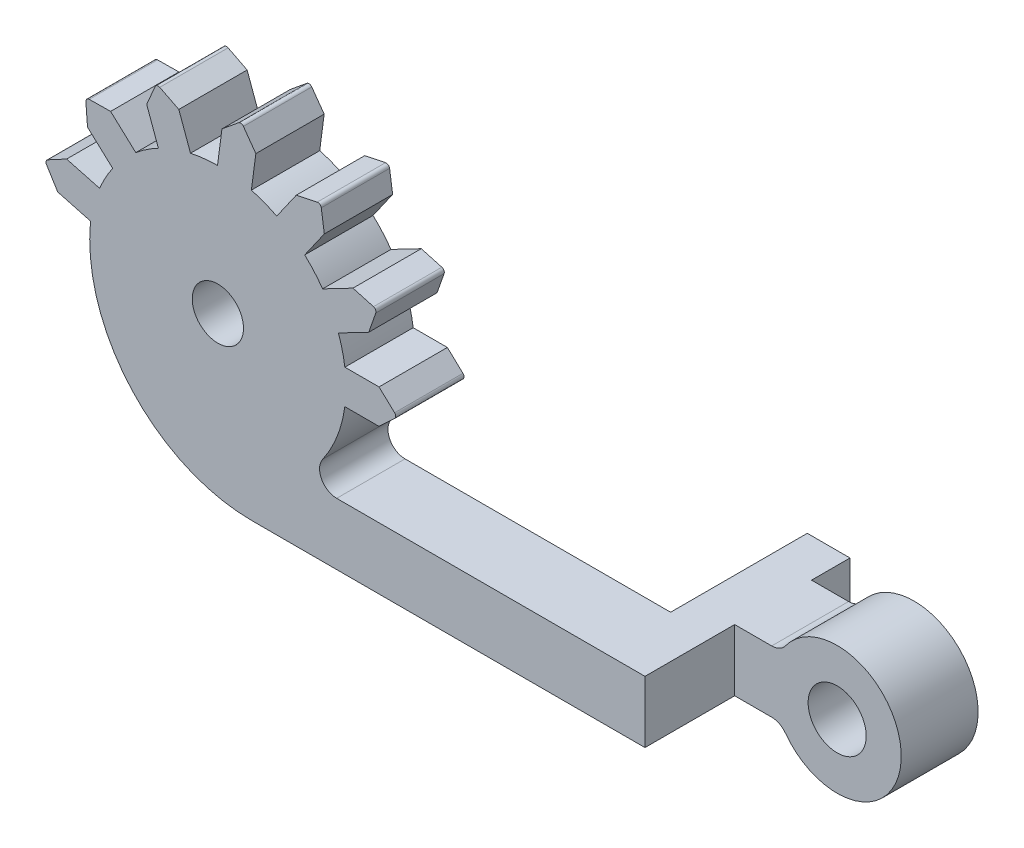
ISO-10303-21;
HEADER;
FILE_DESCRIPTION(('STEP AP214'),'2;1');
FILE_NAME('part.step','',(''),(''),'','','');
FILE_SCHEMA(('AUTOMOTIVE_DESIGN { 1 0 10303 214 1 1 1 1 }'));
ENDSEC;
DATA;
#1=APPLICATION_CONTEXT('core data for automotive mechanical design processes');
#2=APPLICATION_PROTOCOL_DEFINITION('international standard','automotive_design',2000,#1);
#3=PRODUCT_CONTEXT('',#1,'mechanical');
#4=PRODUCT('Part','Part','',(#3));
#5=PRODUCT_RELATED_PRODUCT_CATEGORY('part','',(#4));
#6=PRODUCT_DEFINITION_FORMATION('','',#4);
#7=PRODUCT_DEFINITION_CONTEXT('part definition',#1,'design');
#8=PRODUCT_DEFINITION('design','',#6,#7);
#9=PRODUCT_DEFINITION_SHAPE('','',#8);
#10=(LENGTH_UNIT() NAMED_UNIT(*) SI_UNIT(.MILLI.,.METRE.));
#11=(NAMED_UNIT(*) PLANE_ANGLE_UNIT() SI_UNIT($,.RADIAN.));
#12=(NAMED_UNIT(*) SI_UNIT($,.STERADIAN.) SOLID_ANGLE_UNIT());
#13=UNCERTAINTY_MEASURE_WITH_UNIT(LENGTH_MEASURE(1.E-05),#10,'distance_accuracy_value','');
#14=(GEOMETRIC_REPRESENTATION_CONTEXT(3) GLOBAL_UNCERTAINTY_ASSIGNED_CONTEXT((#13)) GLOBAL_UNIT_ASSIGNED_CONTEXT((#10,
#11,#12)) REPRESENTATION_CONTEXT('',''));
#15=CARTESIAN_POINT('',(0.,0.,0.));
#16=DIRECTION('',(0.,0.,1.));
#17=DIRECTION('',(1.,0.,0.));
#18=AXIS2_PLACEMENT_3D('',#15,#16,#17);
#19=CARTESIAN_POINT('',(66.6183581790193,0.,-4.));
#20=DIRECTION('',(-1.,0.,0.));
#21=DIRECTION('',(0.,0.,1.));
#22=AXIS2_PLACEMENT_3D('',#19,#20,#21);
#23=PLANE('',#22);
#24=DIRECTION('',(0.,-1.,0.));
#25=VECTOR('',#24,1.);
#26=CARTESIAN_POINT('',(66.6183581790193,-3.63149924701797,-5.25));
#27=LINE('',#26,#25);
#28=CARTESIAN_POINT('',(66.6183581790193,-3.63149924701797,-5.25));
#29=VERTEX_POINT('',#28);
#30=CARTESIAN_POINT('',(66.6183581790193,-7.24414509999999,-5.25));
#31=VERTEX_POINT('',#30);
#32=EDGE_CURVE('E52',#29,#31,#27,.T.);
#33=ORIENTED_EDGE('',*,*,#32,.F.);
#34=DIRECTION('',(0.,0.,1.));
#35=VECTOR('',#34,1.);
#36=CARTESIAN_POINT('',(66.6183581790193,-3.63149924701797,-4.));
#37=LINE('',#36,#35);
#38=CARTESIAN_POINT('',(66.6183581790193,-3.63149924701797,0.));
#39=VERTEX_POINT('',#38);
#40=EDGE_CURVE('E44',#29,#39,#37,.T.);
#41=ORIENTED_EDGE('',*,*,#40,.T.);
#42=DIRECTION('',(0.,-1.,0.));
#43=VECTOR('',#42,1.);
#44=CARTESIAN_POINT('',(66.6183581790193,0.,0.));
#45=LINE('',#44,#43);
#46=CARTESIAN_POINT('',(66.6183581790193,-7.24414509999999,0.));
#47=VERTEX_POINT('',#46);
#48=EDGE_CURVE('E389',#39,#47,#45,.T.);
#49=ORIENTED_EDGE('',*,*,#48,.T.);
#50=DIRECTION('',(0.,0.,1.));
#51=VECTOR('',#50,1.);
#52=CARTESIAN_POINT('',(66.6183581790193,-7.24414509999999,-4.));
#53=LINE('',#52,#51);
#54=EDGE_CURVE('E386',#31,#47,#53,.T.);
#55=ORIENTED_EDGE('',*,*,#54,.F.);
#56=EDGE_LOOP('',(#33,#41,#49,#55));
#57=FACE_BOUND('',#56,.T.);
#58=ADVANCED_FACE('F35',(#57),#23,.F.);
#59=CARTESIAN_POINT('',(0.,0.,-4.));
#60=DIRECTION('',(0.,0.,1.));
#61=DIRECTION('',(1.,0.,0.));
#62=AXIS2_PLACEMENT_3D('',#59,#60,#61);
#63=PLANE('',#62);
#64=CARTESIAN_POINT('',(41.6183581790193,2.25585490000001,-4.));
#65=DIRECTION('',(0.,0.,1.));
#66=DIRECTION('',(1.,0.,0.));
#67=AXIS2_PLACEMENT_3D('',#64,#65,#66);
#68=CIRCLE('',#67,1.5);
#69=CARTESIAN_POINT('',(43.1183581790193,2.25585490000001,-4.));
#70=VERTEX_POINT('',#69);
#71=EDGE_CURVE('E756',#70,#70,#68,.T.);
#72=ORIENTED_EDGE('',*,*,#71,.T.);
#73=EDGE_LOOP('',(#72));
#74=FACE_BOUND('',#73,.T.);
#75=DIRECTION('',(0.,1.,0.));
#76=VECTOR('',#75,1.);
#77=CARTESIAN_POINT('',(64.1183581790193,-7.24414509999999,-4.));
#78=LINE('',#77,#76);
#79=CARTESIAN_POINT('',(64.1183581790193,-7.24414509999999,-4.));
#80=VERTEX_POINT('',#79);
#81=CARTESIAN_POINT('',(64.1183581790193,-3.63149924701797,-4.));
#82=VERTEX_POINT('',#81);
#83=EDGE_CURVE('E441',#80,#82,#78,.T.);
#84=ORIENTED_EDGE('',*,*,#83,.F.);
#85=DIRECTION('',(1.,0.,0.));
#86=VECTOR('',#85,1.);
#87=CARTESIAN_POINT('',(0.,-7.24414509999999,-4.));
#88=LINE('',#87,#86);
#89=CARTESIAN_POINT('',(43.6183581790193,-7.24414509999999,-4.));
#90=VERTEX_POINT('',#89);
#91=EDGE_CURVE('E775',#90,#80,#88,.T.);
#92=ORIENTED_EDGE('',*,*,#91,.F.);
#93=CARTESIAN_POINT('',(43.6183581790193,2.25585490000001,-4.));
#94=DIRECTION('',(0.,0.,1.));
#95=DIRECTION('',(1.,0.,0.));
#96=AXIS2_PLACEMENT_3D('',#93,#94,#95);
#97=CIRCLE('',#96,9.5);
#98=CARTESIAN_POINT('',(34.1183581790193,2.25585490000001,-4.));
#99=VERTEX_POINT('',#98);
#100=EDGE_CURVE('E771',#90,#99,#97,.F.);
#101=ORIENTED_EDGE('',*,*,#100,.T.);
#102=CARTESIAN_POINT('',(41.6183581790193,2.25585490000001,-4.));
#103=DIRECTION('',(0.,0.,1.));
#104=DIRECTION('',(1.,0.,0.));
#105=AXIS2_PLACEMENT_3D('',#102,#103,#104);
#106=CIRCLE('',#105,7.49999999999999);
#107=CARTESIAN_POINT('',(34.1797792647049,3.21373993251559,-4.));
#108=VERTEX_POINT('',#107);
#109=EDGE_CURVE('E767',#108,#99,#106,.T.);
#110=ORIENTED_EDGE('',*,*,#109,.F.);
#111=DIRECTION('',(-0.96592582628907,0.258819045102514,0.));
#112=VECTOR('',#111,1.);
#113=CARTESIAN_POINT('',(3.09304604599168,11.5434049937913,-4.));
#114=LINE('',#113,#112);
#115=CARTESIAN_POINT('',(32.2479276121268,3.73137802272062,-4.));
#116=VERTEX_POINT('',#115);
#117=EDGE_CURVE('E723',#108,#116,#114,.T.);
#118=ORIENTED_EDGE('',*,*,#117,.T.);
#119=DIRECTION('',(0.527780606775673,-0.849380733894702,0.));
#120=VECTOR('',#119,1.);
#121=CARTESIAN_POINT('',(24.9379180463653,15.4957005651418,-4.));
#122=LINE('',#121,#120);
#123=CARTESIAN_POINT('',(31.5887617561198,4.79220286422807,-4.));
#124=VERTEX_POINT('',#123);
#125=EDGE_CURVE('E720',#124,#116,#122,.T.);
#126=ORIENTED_EDGE('',*,*,#125,.F.);
#127=CARTESIAN_POINT('',(31.7586379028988,4.8977589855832,-4.));
#128=DIRECTION('',(0.,0.,1.));
#129=DIRECTION('',(1.,0.,0.));
#130=AXIS2_PLACEMENT_3D('',#127,#128,#129);
#131=CIRCLE('',#130,0.2);
#132=CARTESIAN_POINT('',(31.6642989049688,5.07411134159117,-4.));
#133=VERTEX_POINT('',#132);
#134=EDGE_CURVE('E716',#133,#124,#131,.T.);
#135=ORIENTED_EDGE('',*,*,#134,.F.);
#136=DIRECTION('',(0.881761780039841,0.471694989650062,0.));
#137=VECTOR('',#136,1.);
#138=CARTESIAN_POINT('',(4.93474736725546,-9.22475692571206,-4.));
#139=LINE('',#138,#137);
#140=CARTESIAN_POINT('',(32.7655657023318,5.66322967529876,-4.));
#141=VERTEX_POINT('',#140);
#142=EDGE_CURVE('E714',#133,#141,#139,.T.);
#143=ORIENTED_EDGE('',*,*,#142,.T.);
#144=DIRECTION('',(-0.96592582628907,0.258819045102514,0.));
#145=VECTOR('',#144,1.);
#146=CARTESIAN_POINT('',(3.61068413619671,13.4752566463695,-4.));
#147=LINE('',#146,#145);
#148=CARTESIAN_POINT('',(34.69741735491,5.14559158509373,-4.));
#149=VERTEX_POINT('',#148);
#150=EDGE_CURVE('E725',#149,#141,#147,.T.);
#151=ORIENTED_EDGE('',*,*,#150,.F.);
#152=CARTESIAN_POINT('',(35.462560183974,6.54026279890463,-4.));
#153=VERTEX_POINT('',#152);
#154=EDGE_CURVE('E1545',#153,#149,#106,.T.);
#155=ORIENTED_EDGE('',*,*,#154,.F.);
#156=DIRECTION('',(-0.73727733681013,0.675590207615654,0.));
#157=VECTOR('',#156,1.);
#158=CARTESIAN_POINT('',(19.4435847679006,21.2189493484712,-4.));
#159=LINE('',#158,#157);
#160=CARTESIAN_POINT('',(33.9880055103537,7.89144321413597,-4.));
#161=VERTEX_POINT('',#160);
#162=EDGE_CURVE('E681',#153,#161,#159,.T.);
#163=ORIENTED_EDGE('',*,*,#162,.T.);
#164=DIRECTION('',(0.0759467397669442,-0.997111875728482,0.));
#165=VECTOR('',#164,1.);
#166=CARTESIAN_POINT('',(34.3895642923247,2.61934027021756,-4.));
#167=LINE('',#166,#165);
#168=CARTESIAN_POINT('',(33.8931526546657,9.13677526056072,-4.));
#169=VERTEX_POINT('',#168);
#170=EDGE_CURVE('E678',#169,#161,#167,.T.);
#171=ORIENTED_EDGE('',*,*,#170,.F.);
#172=CARTESIAN_POINT('',(34.0925750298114,9.15196460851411,-4.));
#173=DIRECTION('',(0.,0.,1.));
#174=DIRECTION('',(1.,0.,0.));
#175=AXIS2_PLACEMENT_3D('',#172,#173,#174);
#176=CIRCLE('',#175,0.200000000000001);
#177=CARTESIAN_POINT('',(34.0903257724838,9.35195196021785,-4.));
#178=VERTEX_POINT('',#177);
#179=EDGE_CURVE('E674',#178,#169,#176,.T.);
#180=ORIENTED_EDGE('',*,*,#179,.F.);
#181=DIRECTION('',(0.99993675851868,0.0112462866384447,0.));
#182=VECTOR('',#181,1.);
#183=CARTESIAN_POINT('',(-0.100856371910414,8.9674038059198,-4.));
#184=LINE('',#183,#182);
#185=CARTESIAN_POINT('',(35.339185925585,9.36599788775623,-4.));
#186=VERTEX_POINT('',#185);
#187=EDGE_CURVE('E672',#178,#186,#184,.T.);
#188=ORIENTED_EDGE('',*,*,#187,.T.);
#189=DIRECTION('',(-0.737277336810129,0.675590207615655,0.));
#190=VECTOR('',#189,1.);
#191=CARTESIAN_POINT('',(20.7947651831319,22.6935040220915,-4.));
#192=LINE('',#191,#190);
#193=CARTESIAN_POINT('',(36.8137405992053,8.01481747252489,-4.));
#194=VERTEX_POINT('',#193);
#195=EDGE_CURVE('E683',#194,#186,#192,.T.);
#196=ORIENTED_EDGE('',*,*,#195,.F.);
#197=CARTESIAN_POINT('',(38.1364180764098,8.89860230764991,-4.));
#198=VERTEX_POINT('',#197);
#199=EDGE_CURVE('E1532',#198,#194,#106,.T.);
#200=ORIENTED_EDGE('',*,*,#199,.F.);
#201=DIRECTION('',(-0.342020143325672,0.939692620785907,0.));
#202=VECTOR('',#201,1.);
#203=CARTESIAN_POINT('',(36.5352602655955,13.2977472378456,-4.));
#204=LINE('',#203,#202);
#205=CARTESIAN_POINT('',(37.4523777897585,10.7779875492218,-4.));
#206=VERTEX_POINT('',#205);
#207=EDGE_CURVE('E639',#198,#206,#204,.T.);
#208=ORIENTED_EDGE('',*,*,#207,.T.);
#209=DIRECTION('',(-0.393049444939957,-0.919517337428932,0.));
#210=VECTOR('',#209,1.);
#211=CARTESIAN_POINT('',(27.7711050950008,-11.8708119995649,-4.));
#212=LINE('',#211,#210);
#213=CARTESIAN_POINT('',(37.9432726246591,11.9264087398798,-4.));
#214=VERTEX_POINT('',#213);
#215=EDGE_CURVE('E636',#214,#206,#212,.T.);
#216=ORIENTED_EDGE('',*,*,#215,.F.);
#217=CARTESIAN_POINT('',(38.1271760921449,11.8477988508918,-4.));
#218=DIRECTION('',(0.,0.,1.));
#219=DIRECTION('',(1.,0.,0.));
#220=AXIS2_PLACEMENT_3D('',#217,#218,#219);
#221=CIRCLE('',#220,0.199999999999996);
#222=CARTESIAN_POINT('',(38.2175248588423,12.0262283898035,-4.));
#223=VERTEX_POINT('',#222);
#224=EDGE_CURVE('E632',#223,#214,#221,.T.);
#225=ORIENTED_EDGE('',*,*,#224,.F.);
#226=DIRECTION('',(0.892147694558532,-0.451743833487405,0.));
#227=VECTOR('',#226,1.);
#228=CARTESIAN_POINT('',(12.6459827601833,24.9745176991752,-4.));
#229=LINE('',#228,#227);
#230=CARTESIAN_POINT('',(39.3317630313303,11.4620278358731,-4.));
#231=VERTEX_POINT('',#230);
#232=EDGE_CURVE('E630',#223,#231,#229,.T.);
#233=ORIENTED_EDGE('',*,*,#232,.T.);
#234=DIRECTION('',(-0.342020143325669,0.939692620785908,0.));
#235=VECTOR('',#234,1.);
#236=CARTESIAN_POINT('',(38.4146455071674,13.9817875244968,-4.));
#237=LINE('',#236,#235);
#238=CARTESIAN_POINT('',(40.0158033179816,9.58264259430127,-4.));
#239=VERTEX_POINT('',#238);
#240=EDGE_CURVE('E641',#239,#231,#237,.T.);
#241=ORIENTED_EDGE('',*,*,#240,.F.);
#242=CARTESIAN_POINT('',(41.59711899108,9.75582482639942,-4.));
#243=VERTEX_POINT('',#242);
#244=EDGE_CURVE('E1519',#243,#239,#106,.T.);
#245=ORIENTED_EDGE('',*,*,#244,.F.);
#246=DIRECTION('',(0.130526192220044,0.991444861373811,0.));
#247=VECTOR('',#246,1.);
#248=CARTESIAN_POINT('',(39.6259286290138,-5.21685247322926,-4.));
#249=LINE('',#248,#247);
#250=CARTESIAN_POINT('',(41.85817137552,11.7387145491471,-4.));
#251=VERTEX_POINT('',#250);
#252=EDGE_CURVE('E597',#243,#251,#249,.T.);
#253=ORIENTED_EDGE('',*,*,#252,.T.);
#254=DIRECTION('',(-0.773224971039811,-0.634131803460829,0.));
#255=VECTOR('',#254,1.);
#256=CARTESIAN_POINT('',(11.0763361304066,-13.5058668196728,-4.));
#257=LINE('',#256,#255);
#258=CARTESIAN_POINT('',(42.8238823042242,12.5307065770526,-4.));
#259=VERTEX_POINT('',#258);
#260=EDGE_CURVE('E594',#259,#251,#257,.T.);
#261=ORIENTED_EDGE('',*,*,#260,.F.);
#262=CARTESIAN_POINT('',(42.9507086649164,12.3760615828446,-4.));
#263=DIRECTION('',(0.,0.,1.));
#264=DIRECTION('',(1.,0.,0.));
#265=AXIS2_PLACEMENT_3D('',#262,#263,#264);
#266=CIRCLE('',#265,0.200000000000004);
#267=CARTESIAN_POINT('',(43.113238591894,12.4926120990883,-4.));
#268=VERTEX_POINT('',#267);
#269=EDGE_CURVE('E590',#268,#259,#266,.T.);
#270=ORIENTED_EDGE('',*,*,#269,.F.);
#271=DIRECTION('',(0.582752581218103,-0.812649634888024,0.));
#272=VECTOR('',#271,1.);
#273=CARTESIAN_POINT('',(34.3881303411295,24.6597929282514,-4.));
#274=LINE('',#273,#272);
#275=CARTESIAN_POINT('',(43.8410610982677,11.477662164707,-4.));
#276=VERTEX_POINT('',#275);
#277=EDGE_CURVE('E588',#268,#276,#274,.T.);
#278=ORIENTED_EDGE('',*,*,#277,.T.);
#279=DIRECTION('',(0.130526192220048,0.991444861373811,0.));
#280=VECTOR('',#279,1.);
#281=CARTESIAN_POINT('',(41.6088183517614,-5.4779048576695,-4.));
#282=LINE('',#281,#280);
#283=CARTESIAN_POINT('',(43.5800087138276,9.49477244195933,-4.));
#284=VERTEX_POINT('',#283);
#285=EDGE_CURVE('E599',#284,#276,#282,.T.);
#286=ORIENTED_EDGE('',*,*,#285,.F.);
#287=CARTESIAN_POINT('',(45.0626195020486,8.91821663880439,-4.));
#288=VERTEX_POINT('',#287);
#289=EDGE_CURVE('E1506',#288,#284,#106,.T.);
#290=ORIENTED_EDGE('',*,*,#289,.F.);
#291=DIRECTION('',(0.573576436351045,0.819152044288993,0.));
#292=VECTOR('',#291,1.);
#293=CARTESIAN_POINT('',(26.0472803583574,-18.2385020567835,-4.));
#294=LINE('',#293,#292);
#295=CARTESIAN_POINT('',(46.2097723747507,10.5565207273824,-4.));
#296=VERTEX_POINT('',#295);
#297=EDGE_CURVE('E555',#288,#296,#294,.T.);
#298=ORIENTED_EDGE('',*,*,#297,.T.);
#299=DIRECTION('',(-0.978668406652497,-0.205446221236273,0.));
#300=VECTOR('',#299,1.);
#301=CARTESIAN_POINT('',(-0.172104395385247,0.81984050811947,-4.));
#302=LINE('',#301,#300);
#303=CARTESIAN_POINT('',(47.4320696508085,10.8131105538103,-4.));
#304=VERTEX_POINT('',#303);
#305=EDGE_CURVE('E552',#304,#296,#302,.T.);
#306=ORIENTED_EDGE('',*,*,#305,.F.);
#307=CARTESIAN_POINT('',(47.4731588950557,10.6173768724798,-4.));
#308=DIRECTION('',(0.,0.,1.));
#309=DIRECTION('',(1.,0.,0.));
#310=AXIS2_PLACEMENT_3D('',#307,#308,#309);
#311=CIRCLE('',#310,0.199999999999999);
#312=CARTESIAN_POINT('',(47.6711417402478,10.6457104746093,-4.));
#313=VERTEX_POINT('',#312);
#314=EDGE_CURVE('E548',#313,#304,#311,.T.);
#315=ORIENTED_EDGE('',*,*,#314,.F.);
#316=DIRECTION('',(0.141668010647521,-0.9899142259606,0.));
#317=VECTOR('',#316,1.);
#318=CARTESIAN_POINT('',(48.2073359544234,6.89901933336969,-4.));
#319=LINE('',#318,#317);
#320=CARTESIAN_POINT('',(47.8480764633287,9.40936785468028,-4.));
#321=VERTEX_POINT('',#320);
#322=EDGE_CURVE('E546',#313,#321,#319,.T.);
#323=ORIENTED_EDGE('',*,*,#322,.T.);
#324=DIRECTION('',(0.573576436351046,0.819152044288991,0.));
#325=VECTOR('',#324,1.);
#326=CARTESIAN_POINT('',(27.6855844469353,-19.3856549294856,-4.));
#327=LINE('',#326,#325);
#328=CARTESIAN_POINT('',(46.7009235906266,7.77106376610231,-4.));
#329=VERTEX_POINT('',#328);
#330=EDGE_CURVE('E557',#329,#321,#327,.T.);
#331=ORIENTED_EDGE('',*,*,#330,.F.);
#332=CARTESIAN_POINT('',(47.7497915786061,6.57505904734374,-4.));
#333=VERTEX_POINT('',#332);
#334=EDGE_CURVE('E1493',#333,#329,#106,.T.);
#335=ORIENTED_EDGE('',*,*,#334,.F.);
#336=DIRECTION('',(0.88701083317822,0.461748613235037,0.));
#337=VECTOR('',#336,1.);
#338=CARTESIAN_POINT('',(7.48783161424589,-14.3839907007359,-4.));
#339=LINE('',#338,#337);
#340=CARTESIAN_POINT('',(49.5238132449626,7.49855627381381,-4.));
#341=VERTEX_POINT('',#340);
#342=EDGE_CURVE('E513',#333,#341,#339,.T.);
#343=ORIENTED_EDGE('',*,*,#342,.T.);
#344=DIRECTION('',(-0.962953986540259,0.269665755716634,0.));
#345=VECTOR('',#344,1.);
#346=CARTESIAN_POINT('',(5.54854582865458,19.8133957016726,-4.));
#347=LINE('',#346,#345);
#348=CARTESIAN_POINT('',(50.7264841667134,7.16176015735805,-4.));
#349=VERTEX_POINT('',#348);
#350=EDGE_CURVE('E510',#349,#341,#347,.T.);
#351=ORIENTED_EDGE('',*,*,#350,.F.);
#352=CARTESIAN_POINT('',(50.6725510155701,6.96916936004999,-4.));
#353=DIRECTION('',(0.,0.,1.));
#354=DIRECTION('',(1.,0.,0.));
#355=AXIS2_PLACEMENT_3D('',#352,#353,#354);
#356=CIRCLE('',#355,0.200000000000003);
#357=CARTESIAN_POINT('',(50.8612469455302,6.90288326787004,-4.));
#358=VERTEX_POINT('',#357);
#359=EDGE_CURVE('E506',#358,#349,#356,.T.);
#360=ORIENTED_EDGE('',*,*,#359,.F.);
#361=DIRECTION('',(-0.331430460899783,-0.943479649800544,0.));
#362=VECTOR('',#361,1.);
#363=CARTESIAN_POINT('',(43.1158176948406,-15.1459497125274,-4.));
#364=LINE('',#363,#362);
#365=CARTESIAN_POINT('',(50.4473104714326,5.72453460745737,-4.));
#366=VERTEX_POINT('',#365);
#367=EDGE_CURVE('E504',#358,#366,#364,.T.);
#368=ORIENTED_EDGE('',*,*,#367,.T.);
#369=DIRECTION('',(0.88701083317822,0.461748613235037,0.));
#370=VECTOR('',#369,1.);
#371=CARTESIAN_POINT('',(8.41132884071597,-16.1580123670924,-4.));
#372=LINE('',#371,#370);
#373=CARTESIAN_POINT('',(48.6732888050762,4.8010373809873,-4.));
#374=VERTEX_POINT('',#373);
#375=EDGE_CURVE('E515',#374,#366,#372,.T.);
#376=ORIENTED_EDGE('',*,*,#375,.F.);
#377=CARTESIAN_POINT('',(49.0513925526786,3.25585490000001,-4.));
#378=VERTEX_POINT('',#377);
#379=EDGE_CURVE('E772',#378,#374,#106,.T.);
#380=ORIENTED_EDGE('',*,*,#379,.F.);
#381=DIRECTION('',(1.,0.,0.));
#382=VECTOR('',#381,1.);
#383=CARTESIAN_POINT('',(0.,3.25585490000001,-4.));
#384=LINE('',#383,#382);
#385=CARTESIAN_POINT('',(51.0513925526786,3.25585490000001,-4.));
#386=VERTEX_POINT('',#385);
#387=EDGE_CURVE('E471',#378,#386,#384,.T.);
#388=ORIENTED_EDGE('',*,*,#387,.T.);
#389=DIRECTION('',(-0.729632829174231,0.683839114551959,0.));
#390=VECTOR('',#389,1.);
#391=CARTESIAN_POINT('',(25.4979792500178,27.2054674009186,-4.));
#392=LINE('',#391,#390);
#393=CARTESIAN_POINT('',(51.9626595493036,2.40178146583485,-4.));
#394=VERTEX_POINT('',#393);
#395=EDGE_CURVE('E468',#394,#386,#392,.T.);
#396=ORIENTED_EDGE('',*,*,#395,.F.);
#397=CARTESIAN_POINT('',(51.8258917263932,2.25585490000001,-4.));
#398=DIRECTION('',(0.,0.,1.));
#399=DIRECTION('',(1.,0.,0.));
#400=AXIS2_PLACEMENT_3D('',#397,#398,#399);
#401=CIRCLE('',#400,0.199999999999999);
#402=CARTESIAN_POINT('',(51.9626595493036,2.10992833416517,-4.));
#403=VERTEX_POINT('',#402);
#404=EDGE_CURVE('E464',#403,#394,#401,.T.);
#405=ORIENTED_EDGE('',*,*,#404,.F.);
#406=DIRECTION('',(-0.729632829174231,-0.683839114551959,0.));
#407=VECTOR('',#406,1.);
#408=CARTESIAN_POINT('',(23.2468550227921,-24.8035952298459,-4.));
#409=LINE('',#408,#407);
#410=CARTESIAN_POINT('',(51.0513925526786,1.25585490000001,-4.));
#411=VERTEX_POINT('',#410);
#412=EDGE_CURVE('E462',#403,#411,#409,.T.);
#413=ORIENTED_EDGE('',*,*,#412,.T.);
#414=DIRECTION('',(1.,0.,0.));
#415=VECTOR('',#414,1.);
#416=CARTESIAN_POINT('',(0.,1.25585490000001,-4.));
#417=LINE('',#416,#415);
#418=CARTESIAN_POINT('',(49.0513925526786,1.25585490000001,-4.));
#419=VERTEX_POINT('',#418);
#420=EDGE_CURVE('E473',#419,#411,#417,.T.);
#421=ORIENTED_EDGE('',*,*,#420,.F.);
#422=CARTESIAN_POINT('',(47.7545991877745,-2.05651640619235,-4.));
#423=VERTEX_POINT('',#422);
#424=EDGE_CURVE('E768',#423,#419,#106,.T.);
#425=ORIENTED_EDGE('',*,*,#424,.F.);
#426=CARTESIAN_POINT('',(48.5727646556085,-2.631499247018,-4.));
#427=DIRECTION('',(0.,0.,1.));
#428=DIRECTION('',(1.,0.,0.));
#429=AXIS2_PLACEMENT_3D('',#426,#427,#428);
#430=CIRCLE('',#429,1.);
#431=CARTESIAN_POINT('',(48.5727646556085,-3.631499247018,-4.));
#432=VERTEX_POINT('',#431);
#433=EDGE_CURVE('E764',#432,#423,#430,.F.);
#434=ORIENTED_EDGE('',*,*,#433,.F.);
#435=DIRECTION('',(1.,0.,0.));
#436=VECTOR('',#435,1.);
#437=CARTESIAN_POINT('',(0.,-3.63149924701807,-4.));
#438=LINE('',#437,#436);
#439=EDGE_CURVE('E762',#432,#82,#438,.T.);
#440=ORIENTED_EDGE('',*,*,#439,.T.);
#441=EDGE_LOOP('',(#84,#92,#101,#110,#118,#126,#135,#143,#151,#155,#163,#171,#180,#188,#196,
#200,#208,#216,#225,#233,#241,#245,#253,#261,#270,#278,#286,#290,#298,#306,#315,#323,#331,#335,
#343,#351,#360,#368,#376,#380,#388,#396,#405,#413,#421,#425,#434,#440));
#442=FACE_BOUND('',#441,.T.);
#443=ADVANCED_FACE('F904',(#74,#442),#63,.F.);
#444=CARTESIAN_POINT('',(41.6183581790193,2.25585490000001,-4.));
#445=DIRECTION('',(0.,0.,1.));
#446=DIRECTION('',(1.,0.,0.));
#447=AXIS2_PLACEMENT_3D('',#444,#445,#446);
#448=CYLINDRICAL_SURFACE('',#447,7.49999999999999);
#449=CARTESIAN_POINT('',(41.6183581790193,2.25585490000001,0.));
#450=DIRECTION('',(0.,0.,1.));
#451=DIRECTION('',(1.,0.,0.));
#452=AXIS2_PLACEMENT_3D('',#449,#450,#451);
#453=CIRCLE('',#452,7.49999999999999);
#454=CARTESIAN_POINT('',(49.0513925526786,3.25585490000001,0.));
#455=VERTEX_POINT('',#454);
#456=CARTESIAN_POINT('',(48.6732888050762,4.8010373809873,0.));
#457=VERTEX_POINT('',#456);
#458=EDGE_CURVE('E789',#455,#457,#453,.T.);
#459=ORIENTED_EDGE('',*,*,#458,.F.);
#460=DIRECTION('',(0.,0.,1.));
#461=VECTOR('',#460,1.);
#462=CARTESIAN_POINT('',(49.0513925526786,3.25585490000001,-4.));
#463=LINE('',#462,#461);
#464=EDGE_CURVE('E496',#378,#455,#463,.T.);
#465=ORIENTED_EDGE('',*,*,#464,.F.);
#466=ORIENTED_EDGE('',*,*,#379,.T.);
#467=DIRECTION('',(0.,0.,1.));
#468=VECTOR('',#467,1.);
#469=CARTESIAN_POINT('',(48.6732888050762,4.8010373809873,-4.));
#470=LINE('',#469,#468);
#471=EDGE_CURVE('E535',#374,#457,#470,.T.);
#472=ORIENTED_EDGE('',*,*,#471,.T.);
#473=EDGE_LOOP('',(#459,#465,#466,#472));
#474=FACE_BOUND('',#473,.T.);
#475=ADVANCED_FACE('F837',(#474),#448,.T.);
#476=CARTESIAN_POINT('',(47.7497915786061,6.57505904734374,0.));
#477=VERTEX_POINT('',#476);
#478=CARTESIAN_POINT('',(46.7009235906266,7.77106376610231,0.));
#479=VERTEX_POINT('',#478);
#480=EDGE_CURVE('E840',#477,#479,#453,.T.);
#481=ORIENTED_EDGE('',*,*,#480,.F.);
#482=DIRECTION('',(0.,0.,1.));
#483=VECTOR('',#482,1.);
#484=CARTESIAN_POINT('',(47.7497915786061,6.57505904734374,-4.));
#485=LINE('',#484,#483);
#486=EDGE_CURVE('E538',#333,#477,#485,.T.);
#487=ORIENTED_EDGE('',*,*,#486,.F.);
#488=ORIENTED_EDGE('',*,*,#334,.T.);
#489=DIRECTION('',(0.,0.,1.));
#490=VECTOR('',#489,1.);
#491=CARTESIAN_POINT('',(46.7009235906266,7.77106376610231,-4.));
#492=LINE('',#491,#490);
#493=EDGE_CURVE('E577',#329,#479,#492,.T.);
#494=ORIENTED_EDGE('',*,*,#493,.T.);
#495=EDGE_LOOP('',(#481,#487,#488,#494));
#496=FACE_BOUND('',#495,.T.);
#497=ADVANCED_FACE('F913',(#496),#448,.T.);
#498=CARTESIAN_POINT('',(45.0626195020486,8.91821663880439,0.));
#499=VERTEX_POINT('',#498);
#500=CARTESIAN_POINT('',(43.5800087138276,9.49477244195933,0.));
#501=VERTEX_POINT('',#500);
#502=EDGE_CURVE('E841',#499,#501,#453,.T.);
#503=ORIENTED_EDGE('',*,*,#502,.F.);
#504=DIRECTION('',(0.,0.,1.));
#505=VECTOR('',#504,1.);
#506=CARTESIAN_POINT('',(45.0626195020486,8.91821663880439,-4.));
#507=LINE('',#506,#505);
#508=EDGE_CURVE('E580',#288,#499,#507,.T.);
#509=ORIENTED_EDGE('',*,*,#508,.F.);
#510=ORIENTED_EDGE('',*,*,#289,.T.);
#511=DIRECTION('',(0.,0.,1.));
#512=VECTOR('',#511,1.);
#513=CARTESIAN_POINT('',(43.5800087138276,9.49477244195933,-4.));
#514=LINE('',#513,#512);
#515=EDGE_CURVE('E619',#284,#501,#514,.T.);
#516=ORIENTED_EDGE('',*,*,#515,.T.);
#517=EDGE_LOOP('',(#503,#509,#510,#516));
#518=FACE_BOUND('',#517,.T.);
#519=ADVANCED_FACE('F1428',(#518),#448,.T.);
#520=CARTESIAN_POINT('',(41.59711899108,9.75582482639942,0.));
#521=VERTEX_POINT('',#520);
#522=CARTESIAN_POINT('',(40.0158033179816,9.58264259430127,0.));
#523=VERTEX_POINT('',#522);
#524=EDGE_CURVE('E844',#521,#523,#453,.T.);
#525=ORIENTED_EDGE('',*,*,#524,.F.);
#526=DIRECTION('',(0.,0.,1.));
#527=VECTOR('',#526,1.);
#528=CARTESIAN_POINT('',(41.59711899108,9.75582482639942,-4.));
#529=LINE('',#528,#527);
#530=EDGE_CURVE('E622',#243,#521,#529,.T.);
#531=ORIENTED_EDGE('',*,*,#530,.F.);
#532=ORIENTED_EDGE('',*,*,#244,.T.);
#533=DIRECTION('',(0.,0.,1.));
#534=VECTOR('',#533,1.);
#535=CARTESIAN_POINT('',(40.0158033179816,9.58264259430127,-4.));
#536=LINE('',#535,#534);
#537=EDGE_CURVE('E661',#239,#523,#536,.T.);
#538=ORIENTED_EDGE('',*,*,#537,.T.);
#539=EDGE_LOOP('',(#525,#531,#532,#538));
#540=FACE_BOUND('',#539,.T.);
#541=ADVANCED_FACE('F1421',(#540),#448,.T.);
#542=CARTESIAN_POINT('',(38.1364180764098,8.89860230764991,0.));
#543=VERTEX_POINT('',#542);
#544=CARTESIAN_POINT('',(36.8137405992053,8.01481747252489,0.));
#545=VERTEX_POINT('',#544);
#546=EDGE_CURVE('E847',#543,#545,#453,.T.);
#547=ORIENTED_EDGE('',*,*,#546,.F.);
#548=DIRECTION('',(0.,0.,1.));
#549=VECTOR('',#548,1.);
#550=CARTESIAN_POINT('',(38.1364180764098,8.89860230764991,-4.));
#551=LINE('',#550,#549);
#552=EDGE_CURVE('E664',#198,#543,#551,.T.);
#553=ORIENTED_EDGE('',*,*,#552,.F.);
#554=ORIENTED_EDGE('',*,*,#199,.T.);
#555=DIRECTION('',(0.,0.,1.));
#556=VECTOR('',#555,1.);
#557=CARTESIAN_POINT('',(36.8137405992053,8.01481747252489,-4.));
#558=LINE('',#557,#556);
#559=EDGE_CURVE('E703',#194,#545,#558,.T.);
#560=ORIENTED_EDGE('',*,*,#559,.T.);
#561=EDGE_LOOP('',(#547,#553,#554,#560));
#562=FACE_BOUND('',#561,.T.);
#563=ADVANCED_FACE('F1414',(#562),#448,.T.);
#564=CARTESIAN_POINT('',(35.462560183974,6.54026279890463,0.));
#565=VERTEX_POINT('',#564);
#566=CARTESIAN_POINT('',(34.69741735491,5.14559158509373,0.));
#567=VERTEX_POINT('',#566);
#568=EDGE_CURVE('E850',#565,#567,#453,.T.);
#569=ORIENTED_EDGE('',*,*,#568,.F.);
#570=DIRECTION('',(0.,0.,1.));
#571=VECTOR('',#570,1.);
#572=CARTESIAN_POINT('',(35.462560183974,6.54026279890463,-4.));
#573=LINE('',#572,#571);
#574=EDGE_CURVE('E706',#153,#565,#573,.T.);
#575=ORIENTED_EDGE('',*,*,#574,.F.);
#576=ORIENTED_EDGE('',*,*,#154,.T.);
#577=DIRECTION('',(0.,0.,1.));
#578=VECTOR('',#577,1.);
#579=CARTESIAN_POINT('',(34.69741735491,5.14559158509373,-4.));
#580=LINE('',#579,#578);
#581=EDGE_CURVE('E745',#149,#567,#580,.T.);
#582=ORIENTED_EDGE('',*,*,#581,.T.);
#583=EDGE_LOOP('',(#569,#575,#576,#582));
#584=FACE_BOUND('',#583,.T.);
#585=ADVANCED_FACE('F1411',(#584),#448,.T.);
#586=CARTESIAN_POINT('',(34.1797792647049,3.21373993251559,0.));
#587=VERTEX_POINT('',#586);
#588=CARTESIAN_POINT('',(34.1183581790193,2.25585490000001,0.));
#589=VERTEX_POINT('',#588);
#590=EDGE_CURVE('E784',#587,#589,#453,.T.);
#591=ORIENTED_EDGE('',*,*,#590,.F.);
#592=DIRECTION('',(0.,0.,1.));
#593=VECTOR('',#592,1.);
#594=CARTESIAN_POINT('',(34.1797792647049,3.21373993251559,-4.));
#595=LINE('',#594,#593);
#596=EDGE_CURVE('E748',#108,#587,#595,.T.);
#597=ORIENTED_EDGE('',*,*,#596,.F.);
#598=ORIENTED_EDGE('',*,*,#109,.T.);
#599=DIRECTION('',(0.,0.,1.));
#600=VECTOR('',#599,1.);
#601=CARTESIAN_POINT('',(34.1183581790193,2.25585490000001,-4.));
#602=LINE('',#601,#600);
#603=EDGE_CURVE('E797',#99,#589,#602,.T.);
#604=ORIENTED_EDGE('',*,*,#603,.T.);
#605=EDGE_LOOP('',(#591,#597,#598,#604));
#606=FACE_BOUND('',#605,.T.);
#607=ADVANCED_FACE('F860',(#606),#448,.T.);
#608=CARTESIAN_POINT('',(0.,-3.63149924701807,-4.));
#609=DIRECTION('',(0.,-1.,0.));
#610=DIRECTION('',(1.,0.,0.));
#611=AXIS2_PLACEMENT_3D('',#608,#609,#610);
#612=PLANE('',#611);
#613=DIRECTION('',(1.,0.,0.));
#614=VECTOR('',#613,1.);
#615=CARTESIAN_POINT('',(0.,-3.63149924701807,0.));
#616=LINE('',#615,#614);
#617=CARTESIAN_POINT('',(48.5727646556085,-3.631499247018,0.));
#618=VERTEX_POINT('',#617);
#619=EDGE_CURVE('E759',#618,#39,#616,.T.);
#620=ORIENTED_EDGE('',*,*,#619,.T.);
#621=ORIENTED_EDGE('',*,*,#40,.F.);
#622=DIRECTION('',(-1.,0.,0.));
#623=VECTOR('',#622,1.);
#624=CARTESIAN_POINT('',(68.7859892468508,-3.63149924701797,-5.25));
#625=LINE('',#624,#623);
#626=CARTESIAN_POINT('',(68.7859892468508,-3.63149924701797,-5.25));
#627=VERTEX_POINT('',#626);
#628=EDGE_CURVE('E408',#627,#29,#625,.T.);
#629=ORIENTED_EDGE('',*,*,#628,.F.);
#630=DIRECTION('',(0.,0.,-1.));
#631=VECTOR('',#630,1.);
#632=CARTESIAN_POINT('',(68.7859892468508,-3.63149924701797,-5.25));
#633=LINE('',#632,#631);
#634=CARTESIAN_POINT('',(68.7859892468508,-3.63149924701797,-9.75));
#635=VERTEX_POINT('',#634);
#636=EDGE_CURVE('E422',#627,#635,#633,.T.);
#637=ORIENTED_EDGE('',*,*,#636,.T.);
#638=DIRECTION('',(-1.,0.,0.));
#639=VECTOR('',#638,1.);
#640=CARTESIAN_POINT('',(68.7859892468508,-3.63149924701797,-9.75));
#641=LINE('',#640,#639);
#642=CARTESIAN_POINT('',(66.6183581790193,-3.63149924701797,-9.75));
#643=VERTEX_POINT('',#642);
#644=EDGE_CURVE('E409',#635,#643,#641,.T.);
#645=ORIENTED_EDGE('',*,*,#644,.T.);
#646=CARTESIAN_POINT('',(66.6183581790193,-3.63149924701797,-12.));
#647=VERTEX_POINT('',#646);
#648=EDGE_CURVE('E11',#647,#643,#37,.T.);
#649=ORIENTED_EDGE('',*,*,#648,.F.);
#650=DIRECTION('',(1.,0.,0.));
#651=VECTOR('',#650,1.);
#652=CARTESIAN_POINT('',(66.6183581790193,-3.63149924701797,-12.));
#653=LINE('',#652,#651);
#654=CARTESIAN_POINT('',(64.1183581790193,-3.63149924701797,-12.));
#655=VERTEX_POINT('',#654);
#656=EDGE_CURVE('E447',#655,#647,#653,.T.);
#657=ORIENTED_EDGE('',*,*,#656,.F.);
#658=DIRECTION('',(0.,0.,1.));
#659=VECTOR('',#658,1.);
#660=CARTESIAN_POINT('',(64.1183581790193,-3.63149924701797,-12.));
#661=LINE('',#660,#659);
#662=EDGE_CURVE('E453',#655,#82,#661,.T.);
#663=ORIENTED_EDGE('',*,*,#662,.T.);
#664=ORIENTED_EDGE('',*,*,#439,.F.);
#665=DIRECTION('',(0.,0.,1.));
#666=VECTOR('',#665,1.);
#667=CARTESIAN_POINT('',(48.5727646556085,-3.631499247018,-4.));
#668=LINE('',#667,#666);
#669=EDGE_CURVE('E778',#432,#618,#668,.T.);
#670=ORIENTED_EDGE('',*,*,#669,.T.);
#671=EDGE_LOOP('',(#620,#621,#629,#637,#645,#649,#657,#663,#664,#670));
#672=FACE_BOUND('',#671,.T.);
#673=ADVANCED_FACE('F37',(#672),#612,.F.);
#674=ORIENTED_EDGE('',*,*,#648,.T.);
#675=DIRECTION('',(0.,-1.,0.));
#676=VECTOR('',#675,1.);
#677=CARTESIAN_POINT('',(66.6183581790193,-3.63149924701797,-9.75));
#678=LINE('',#677,#676);
#679=CARTESIAN_POINT('',(66.6183581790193,-7.24414509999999,-9.75));
#680=VERTEX_POINT('',#679);
#681=EDGE_CURVE('E423',#643,#680,#678,.T.);
#682=ORIENTED_EDGE('',*,*,#681,.T.);
#683=CARTESIAN_POINT('',(66.6183581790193,-7.24414509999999,-12.));
#684=VERTEX_POINT('',#683);
#685=EDGE_CURVE('E393',#684,#680,#53,.T.);
#686=ORIENTED_EDGE('',*,*,#685,.F.);
#687=DIRECTION('',(0.,-1.,0.));
#688=VECTOR('',#687,1.);
#689=CARTESIAN_POINT('',(66.6183581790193,-7.24414509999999,-12.));
#690=LINE('',#689,#688);
#691=EDGE_CURVE('E450',#647,#684,#690,.T.);
#692=ORIENTED_EDGE('',*,*,#691,.F.);
#693=EDGE_LOOP('',(#674,#682,#686,#692));
#694=FACE_BOUND('',#693,.T.);
#695=ADVANCED_FACE('F894',(#694),#23,.F.);
#696=CARTESIAN_POINT('',(0.,-7.24414509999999,-4.));
#697=DIRECTION('',(0.,-1.,0.));
#698=DIRECTION('',(0.,0.,-1.));
#699=AXIS2_PLACEMENT_3D('',#696,#697,#698);
#700=PLANE('',#699);
#701=DIRECTION('',(1.,0.,0.));
#702=VECTOR('',#701,1.);
#703=CARTESIAN_POINT('',(0.,-7.24414509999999,0.));
#704=LINE('',#703,#702);
#705=CARTESIAN_POINT('',(43.6183581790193,-7.24414509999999,0.));
#706=VERTEX_POINT('',#705);
#707=EDGE_CURVE('E792',#706,#47,#704,.T.);
#708=ORIENTED_EDGE('',*,*,#707,.F.);
#709=DIRECTION('',(0.,0.,1.));
#710=VECTOR('',#709,1.);
#711=CARTESIAN_POINT('',(43.6183581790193,-7.24414509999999,-4.));
#712=LINE('',#711,#710);
#713=EDGE_CURVE('E394',#90,#706,#712,.T.);
#714=ORIENTED_EDGE('',*,*,#713,.F.);
#715=ORIENTED_EDGE('',*,*,#91,.T.);
#716=DIRECTION('',(0.,0.,1.));
#717=VECTOR('',#716,1.);
#718=CARTESIAN_POINT('',(64.1183581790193,-7.24414509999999,-12.));
#719=LINE('',#718,#717);
#720=CARTESIAN_POINT('',(64.1183581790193,-7.24414509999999,-12.));
#721=VERTEX_POINT('',#720);
#722=EDGE_CURVE('E458',#721,#80,#719,.T.);
#723=ORIENTED_EDGE('',*,*,#722,.F.);
#724=DIRECTION('',(-1.,0.,0.));
#725=VECTOR('',#724,1.);
#726=CARTESIAN_POINT('',(66.6183581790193,-7.24414509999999,-12.));
#727=LINE('',#726,#725);
#728=EDGE_CURVE('E442',#684,#721,#727,.T.);
#729=ORIENTED_EDGE('',*,*,#728,.F.);
#730=ORIENTED_EDGE('',*,*,#685,.T.);
#731=DIRECTION('',(1.,0.,0.));
#732=VECTOR('',#731,1.);
#733=CARTESIAN_POINT('',(66.6183581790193,-7.24414509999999,-9.75));
#734=LINE('',#733,#732);
#735=CARTESIAN_POINT('',(68.7859892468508,-7.2441451,-9.75));
#736=VERTEX_POINT('',#735);
#737=EDGE_CURVE('E425',#680,#736,#734,.T.);
#738=ORIENTED_EDGE('',*,*,#737,.T.);
#739=DIRECTION('',(0.,0.,-1.));
#740=VECTOR('',#739,1.);
#741=CARTESIAN_POINT('',(68.7859892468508,-7.2441451,-5.25));
#742=LINE('',#741,#740);
#743=CARTESIAN_POINT('',(68.7859892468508,-7.2441451,-5.25));
#744=VERTEX_POINT('',#743);
#745=EDGE_CURVE('E400',#744,#736,#742,.T.);
#746=ORIENTED_EDGE('',*,*,#745,.F.);
#747=DIRECTION('',(1.,0.,0.));
#748=VECTOR('',#747,1.);
#749=CARTESIAN_POINT('',(66.6183581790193,-7.24414509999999,-5.25));
#750=LINE('',#749,#748);
#751=EDGE_CURVE('E397',#31,#744,#750,.T.);
#752=ORIENTED_EDGE('',*,*,#751,.F.);
#753=ORIENTED_EDGE('',*,*,#54,.T.);
#754=EDGE_LOOP('',(#708,#714,#715,#723,#729,#730,#738,#746,#752,#753));
#755=FACE_BOUND('',#754,.T.);
#756=ADVANCED_FACE('F398',(#755),#700,.T.);
#757=CARTESIAN_POINT('',(43.6183581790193,2.25585490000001,-4.));
#758=DIRECTION('',(0.,0.,1.));
#759=DIRECTION('',(1.,0.,0.));
#760=AXIS2_PLACEMENT_3D('',#757,#758,#759);
#761=CYLINDRICAL_SURFACE('',#760,9.5);
#762=CARTESIAN_POINT('',(43.6183581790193,2.25585490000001,0.));
#763=DIRECTION('',(0.,0.,1.));
#764=DIRECTION('',(1.,0.,0.));
#765=AXIS2_PLACEMENT_3D('',#762,#763,#764);
#766=CIRCLE('',#765,9.5);
#767=EDGE_CURVE('E788',#706,#589,#766,.F.);
#768=ORIENTED_EDGE('',*,*,#767,.T.);
#769=ORIENTED_EDGE('',*,*,#603,.F.);
#770=ORIENTED_EDGE('',*,*,#100,.F.);
#771=ORIENTED_EDGE('',*,*,#713,.T.);
#772=EDGE_LOOP('',(#768,#769,#770,#771));
#773=FACE_BOUND('',#772,.T.);
#774=ADVANCED_FACE('F864',(#773),#761,.T.);
#775=DIRECTION('',(0.,0.,1.));
#776=VECTOR('',#775,1.);
#777=CARTESIAN_POINT('',(49.0513925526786,1.25585490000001,-4.));
#778=LINE('',#777,#776);
#779=CARTESIAN_POINT('',(49.0513925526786,1.25585490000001,0.));
#780=VERTEX_POINT('',#779);
#781=EDGE_CURVE('E493',#419,#780,#778,.T.);
#782=ORIENTED_EDGE('',*,*,#781,.T.);
#783=CARTESIAN_POINT('',(47.7545991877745,-2.05651640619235,0.));
#784=VERTEX_POINT('',#783);
#785=EDGE_CURVE('E785',#784,#780,#453,.T.);
#786=ORIENTED_EDGE('',*,*,#785,.F.);
#787=DIRECTION('',(0.,0.,1.));
#788=VECTOR('',#787,1.);
#789=CARTESIAN_POINT('',(47.7545991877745,-2.05651640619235,-4.));
#790=LINE('',#789,#788);
#791=EDGE_CURVE('E800',#423,#784,#790,.T.);
#792=ORIENTED_EDGE('',*,*,#791,.F.);
#793=ORIENTED_EDGE('',*,*,#424,.T.);
#794=EDGE_LOOP('',(#782,#786,#792,#793));
#795=FACE_BOUND('',#794,.T.);
#796=ADVANCED_FACE('F813',(#795),#448,.T.);
#797=CARTESIAN_POINT('',(48.5727646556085,-2.631499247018,-4.));
#798=DIRECTION('',(0.,0.,1.));
#799=DIRECTION('',(1.,0.,0.));
#800=AXIS2_PLACEMENT_3D('',#797,#798,#799);
#801=CYLINDRICAL_SURFACE('',#800,1.);
#802=CARTESIAN_POINT('',(48.5727646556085,-2.631499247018,0.));
#803=DIRECTION('',(0.,0.,1.));
#804=DIRECTION('',(1.,0.,0.));
#805=AXIS2_PLACEMENT_3D('',#802,#803,#804);
#806=CIRCLE('',#805,1.);
#807=EDGE_CURVE('E781',#618,#784,#806,.F.);
#808=ORIENTED_EDGE('',*,*,#807,.F.);
#809=ORIENTED_EDGE('',*,*,#669,.F.);
#810=ORIENTED_EDGE('',*,*,#433,.T.);
#811=ORIENTED_EDGE('',*,*,#791,.T.);
#812=EDGE_LOOP('',(#808,#809,#810,#811));
#813=FACE_BOUND('',#812,.T.);
#814=ADVANCED_FACE('F809',(#813),#801,.F.);
#815=CARTESIAN_POINT('',(0.,0.,0.));
#816=DIRECTION('',(0.,0.,1.));
#817=DIRECTION('',(1.,0.,0.));
#818=AXIS2_PLACEMENT_3D('',#815,#816,#817);
#819=PLANE('',#818);
#820=CARTESIAN_POINT('',(41.6183581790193,2.25585490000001,0.));
#821=DIRECTION('',(0.,0.,1.));
#822=DIRECTION('',(1.,0.,0.));
#823=AXIS2_PLACEMENT_3D('',#820,#821,#822);
#824=CIRCLE('',#823,1.5);
#825=CARTESIAN_POINT('',(43.1183581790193,2.25585490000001,0.));
#826=VERTEX_POINT('',#825);
#827=EDGE_CURVE('E744',#826,#826,#824,.T.);
#828=ORIENTED_EDGE('',*,*,#827,.F.);
#829=EDGE_LOOP('',(#828));
#830=FACE_BOUND('',#829,.T.);
#831=ORIENTED_EDGE('',*,*,#619,.F.);
#832=ORIENTED_EDGE('',*,*,#807,.T.);
#833=ORIENTED_EDGE('',*,*,#785,.T.);
#834=DIRECTION('',(1.,0.,0.));
#835=VECTOR('',#834,1.);
#836=CARTESIAN_POINT('',(0.,1.25585490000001,0.));
#837=LINE('',#836,#835);
#838=CARTESIAN_POINT('',(51.0513925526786,1.25585490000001,0.));
#839=VERTEX_POINT('',#838);
#840=EDGE_CURVE('E465',#780,#839,#837,.T.);
#841=ORIENTED_EDGE('',*,*,#840,.T.);
#842=DIRECTION('',(-0.729632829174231,-0.683839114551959,0.));
#843=VECTOR('',#842,1.);
#844=CARTESIAN_POINT('',(23.2468550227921,-24.8035952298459,0.));
#845=LINE('',#844,#843);
#846=CARTESIAN_POINT('',(51.9626595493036,2.10992833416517,0.));
#847=VERTEX_POINT('',#846);
#848=EDGE_CURVE('E461',#847,#839,#845,.T.);
#849=ORIENTED_EDGE('',*,*,#848,.F.);
#850=CARTESIAN_POINT('',(51.8258917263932,2.25585490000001,0.));
#851=DIRECTION('',(0.,0.,1.));
#852=DIRECTION('',(1.,0.,0.));
#853=AXIS2_PLACEMENT_3D('',#850,#851,#852);
#854=CIRCLE('',#853,0.199999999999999);
#855=CARTESIAN_POINT('',(51.9626595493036,2.40178146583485,0.));
#856=VERTEX_POINT('',#855);
#857=EDGE_CURVE('E479',#847,#856,#854,.T.);
#858=ORIENTED_EDGE('',*,*,#857,.T.);
#859=DIRECTION('',(-0.729632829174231,0.683839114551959,0.));
#860=VECTOR('',#859,1.);
#861=CARTESIAN_POINT('',(25.4979792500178,27.2054674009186,0.));
#862=LINE('',#861,#860);
#863=CARTESIAN_POINT('',(51.0513925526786,3.25585490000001,0.));
#864=VERTEX_POINT('',#863);
#865=EDGE_CURVE('E482',#856,#864,#862,.T.);
#866=ORIENTED_EDGE('',*,*,#865,.T.);
#867=DIRECTION('',(1.,0.,0.));
#868=VECTOR('',#867,1.);
#869=CARTESIAN_POINT('',(0.,3.25585490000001,0.));
#870=LINE('',#869,#868);
#871=EDGE_CURVE('E485',#455,#864,#870,.T.);
#872=ORIENTED_EDGE('',*,*,#871,.F.);
#873=ORIENTED_EDGE('',*,*,#458,.T.);
#874=DIRECTION('',(0.88701083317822,0.461748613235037,0.));
#875=VECTOR('',#874,1.);
#876=CARTESIAN_POINT('',(8.41132884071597,-16.1580123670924,0.));
#877=LINE('',#876,#875);
#878=CARTESIAN_POINT('',(50.4473104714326,5.72453460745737,0.));
#879=VERTEX_POINT('',#878);
#880=EDGE_CURVE('E507',#457,#879,#877,.T.);
#881=ORIENTED_EDGE('',*,*,#880,.T.);
#882=DIRECTION('',(-0.331430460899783,-0.943479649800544,0.));
#883=VECTOR('',#882,1.);
#884=CARTESIAN_POINT('',(43.1158176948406,-15.1459497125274,0.));
#885=LINE('',#884,#883);
#886=CARTESIAN_POINT('',(50.8612469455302,6.90288326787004,0.));
#887=VERTEX_POINT('',#886);
#888=EDGE_CURVE('E492',#887,#879,#885,.T.);
#889=ORIENTED_EDGE('',*,*,#888,.F.);
#890=CARTESIAN_POINT('',(50.6725510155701,6.96916936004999,0.));
#891=DIRECTION('',(0.,0.,1.));
#892=DIRECTION('',(1.,0.,0.));
#893=AXIS2_PLACEMENT_3D('',#890,#891,#892);
#894=CIRCLE('',#893,0.200000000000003);
#895=CARTESIAN_POINT('',(50.7264841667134,7.16176015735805,0.));
#896=VERTEX_POINT('',#895);
#897=EDGE_CURVE('E521',#887,#896,#894,.T.);
#898=ORIENTED_EDGE('',*,*,#897,.T.);
#899=DIRECTION('',(-0.962953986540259,0.269665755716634,0.));
#900=VECTOR('',#899,1.);
#901=CARTESIAN_POINT('',(5.54854582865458,19.8133957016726,0.));
#902=LINE('',#901,#900);
#903=CARTESIAN_POINT('',(49.5238132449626,7.49855627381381,0.));
#904=VERTEX_POINT('',#903);
#905=EDGE_CURVE('E524',#896,#904,#902,.T.);
#906=ORIENTED_EDGE('',*,*,#905,.T.);
#907=DIRECTION('',(0.88701083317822,0.461748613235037,0.));
#908=VECTOR('',#907,1.);
#909=CARTESIAN_POINT('',(7.48783161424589,-14.3839907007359,0.));
#910=LINE('',#909,#908);
#911=EDGE_CURVE('E527',#477,#904,#910,.T.);
#912=ORIENTED_EDGE('',*,*,#911,.F.);
#913=ORIENTED_EDGE('',*,*,#480,.T.);
#914=DIRECTION('',(0.573576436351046,0.819152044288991,0.));
#915=VECTOR('',#914,1.);
#916=CARTESIAN_POINT('',(27.6855844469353,-19.3856549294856,0.));
#917=LINE('',#916,#915);
#918=CARTESIAN_POINT('',(47.8480764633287,9.40936785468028,0.));
#919=VERTEX_POINT('',#918);
#920=EDGE_CURVE('E549',#479,#919,#917,.T.);
#921=ORIENTED_EDGE('',*,*,#920,.T.);
#922=DIRECTION('',(0.141668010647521,-0.9899142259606,0.));
#923=VECTOR('',#922,1.);
#924=CARTESIAN_POINT('',(48.2073359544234,6.89901933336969,0.));
#925=LINE('',#924,#923);
#926=CARTESIAN_POINT('',(47.6711417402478,10.6457104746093,0.));
#927=VERTEX_POINT('',#926);
#928=EDGE_CURVE('E534',#927,#919,#925,.T.);
#929=ORIENTED_EDGE('',*,*,#928,.F.);
#930=CARTESIAN_POINT('',(47.4731588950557,10.6173768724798,0.));
#931=DIRECTION('',(0.,0.,1.));
#932=DIRECTION('',(1.,0.,0.));
#933=AXIS2_PLACEMENT_3D('',#930,#931,#932);
#934=CIRCLE('',#933,0.199999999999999);
#935=CARTESIAN_POINT('',(47.4320696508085,10.8131105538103,0.));
#936=VERTEX_POINT('',#935);
#937=EDGE_CURVE('E563',#927,#936,#934,.T.);
#938=ORIENTED_EDGE('',*,*,#937,.T.);
#939=DIRECTION('',(-0.978668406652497,-0.205446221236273,0.));
#940=VECTOR('',#939,1.);
#941=CARTESIAN_POINT('',(-0.172104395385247,0.81984050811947,0.));
#942=LINE('',#941,#940);
#943=CARTESIAN_POINT('',(46.2097723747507,10.5565207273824,0.));
#944=VERTEX_POINT('',#943);
#945=EDGE_CURVE('E566',#936,#944,#942,.T.);
#946=ORIENTED_EDGE('',*,*,#945,.T.);
#947=DIRECTION('',(0.573576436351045,0.819152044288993,0.));
#948=VECTOR('',#947,1.);
#949=CARTESIAN_POINT('',(26.0472803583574,-18.2385020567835,0.));
#950=LINE('',#949,#948);
#951=EDGE_CURVE('E569',#499,#944,#950,.T.);
#952=ORIENTED_EDGE('',*,*,#951,.F.);
#953=ORIENTED_EDGE('',*,*,#502,.T.);
#954=DIRECTION('',(0.130526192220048,0.991444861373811,0.));
#955=VECTOR('',#954,1.);
#956=CARTESIAN_POINT('',(41.6088183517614,-5.4779048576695,0.));
#957=LINE('',#956,#955);
#958=CARTESIAN_POINT('',(43.8410610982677,11.477662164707,0.));
#959=VERTEX_POINT('',#958);
#960=EDGE_CURVE('E591',#501,#959,#957,.T.);
#961=ORIENTED_EDGE('',*,*,#960,.T.);
#962=DIRECTION('',(0.582752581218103,-0.812649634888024,0.));
#963=VECTOR('',#962,1.);
#964=CARTESIAN_POINT('',(34.3881303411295,24.6597929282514,0.));
#965=LINE('',#964,#963);
#966=CARTESIAN_POINT('',(43.113238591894,12.4926120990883,0.));
#967=VERTEX_POINT('',#966);
#968=EDGE_CURVE('E576',#967,#959,#965,.T.);
#969=ORIENTED_EDGE('',*,*,#968,.F.);
#970=CARTESIAN_POINT('',(42.9507086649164,12.3760615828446,0.));
#971=DIRECTION('',(0.,0.,1.));
#972=DIRECTION('',(1.,0.,0.));
#973=AXIS2_PLACEMENT_3D('',#970,#971,#972);
#974=CIRCLE('',#973,0.200000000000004);
#975=CARTESIAN_POINT('',(42.8238823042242,12.5307065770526,0.));
#976=VERTEX_POINT('',#975);
#977=EDGE_CURVE('E605',#967,#976,#974,.T.);
#978=ORIENTED_EDGE('',*,*,#977,.T.);
#979=DIRECTION('',(-0.773224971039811,-0.634131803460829,0.));
#980=VECTOR('',#979,1.);
#981=CARTESIAN_POINT('',(11.0763361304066,-13.5058668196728,0.));
#982=LINE('',#981,#980);
#983=CARTESIAN_POINT('',(41.85817137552,11.7387145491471,0.));
#984=VERTEX_POINT('',#983);
#985=EDGE_CURVE('E608',#976,#984,#982,.T.);
#986=ORIENTED_EDGE('',*,*,#985,.T.);
#987=DIRECTION('',(0.130526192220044,0.991444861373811,0.));
#988=VECTOR('',#987,1.);
#989=CARTESIAN_POINT('',(39.6259286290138,-5.21685247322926,0.));
#990=LINE('',#989,#988);
#991=EDGE_CURVE('E611',#521,#984,#990,.T.);
#992=ORIENTED_EDGE('',*,*,#991,.F.);
#993=ORIENTED_EDGE('',*,*,#524,.T.);
#994=DIRECTION('',(-0.342020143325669,0.939692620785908,0.));
#995=VECTOR('',#994,1.);
#996=CARTESIAN_POINT('',(38.4146455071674,13.9817875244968,0.));
#997=LINE('',#996,#995);
#998=CARTESIAN_POINT('',(39.3317630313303,11.4620278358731,0.));
#999=VERTEX_POINT('',#998);
#1000=EDGE_CURVE('E633',#523,#999,#997,.T.);
#1001=ORIENTED_EDGE('',*,*,#1000,.T.);
#1002=DIRECTION('',(0.892147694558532,-0.451743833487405,0.));
#1003=VECTOR('',#1002,1.);
#1004=CARTESIAN_POINT('',(12.6459827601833,24.9745176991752,0.));
#1005=LINE('',#1004,#1003);
#1006=CARTESIAN_POINT('',(38.2175248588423,12.0262283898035,0.));
#1007=VERTEX_POINT('',#1006);
#1008=EDGE_CURVE('E618',#1007,#999,#1005,.T.);
#1009=ORIENTED_EDGE('',*,*,#1008,.F.);
#1010=CARTESIAN_POINT('',(38.1271760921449,11.8477988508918,0.));
#1011=DIRECTION('',(0.,0.,1.));
#1012=DIRECTION('',(1.,0.,0.));
#1013=AXIS2_PLACEMENT_3D('',#1010,#1011,#1012);
#1014=CIRCLE('',#1013,0.199999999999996);
#1015=CARTESIAN_POINT('',(37.9432726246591,11.9264087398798,0.));
#1016=VERTEX_POINT('',#1015);
#1017=EDGE_CURVE('E647',#1007,#1016,#1014,.T.);
#1018=ORIENTED_EDGE('',*,*,#1017,.T.);
#1019=DIRECTION('',(-0.393049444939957,-0.919517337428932,0.));
#1020=VECTOR('',#1019,1.);
#1021=CARTESIAN_POINT('',(27.7711050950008,-11.8708119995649,0.));
#1022=LINE('',#1021,#1020);
#1023=CARTESIAN_POINT('',(37.4523777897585,10.7779875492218,0.));
#1024=VERTEX_POINT('',#1023);
#1025=EDGE_CURVE('E650',#1016,#1024,#1022,.T.);
#1026=ORIENTED_EDGE('',*,*,#1025,.T.);
#1027=DIRECTION('',(-0.342020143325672,0.939692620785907,0.));
#1028=VECTOR('',#1027,1.);
#1029=CARTESIAN_POINT('',(36.5352602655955,13.2977472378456,0.));
#1030=LINE('',#1029,#1028);
#1031=EDGE_CURVE('E653',#543,#1024,#1030,.T.);
#1032=ORIENTED_EDGE('',*,*,#1031,.F.);
#1033=ORIENTED_EDGE('',*,*,#546,.T.);
#1034=DIRECTION('',(-0.737277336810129,0.675590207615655,0.));
#1035=VECTOR('',#1034,1.);
#1036=CARTESIAN_POINT('',(20.7947651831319,22.6935040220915,0.));
#1037=LINE('',#1036,#1035);
#1038=CARTESIAN_POINT('',(35.339185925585,9.36599788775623,0.));
#1039=VERTEX_POINT('',#1038);
#1040=EDGE_CURVE('E675',#545,#1039,#1037,.T.);
#1041=ORIENTED_EDGE('',*,*,#1040,.T.);
#1042=DIRECTION('',(0.99993675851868,0.0112462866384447,0.));
#1043=VECTOR('',#1042,1.);
#1044=CARTESIAN_POINT('',(-0.100856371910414,8.9674038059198,0.));
#1045=LINE('',#1044,#1043);
#1046=CARTESIAN_POINT('',(34.0903257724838,9.35195196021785,0.));
#1047=VERTEX_POINT('',#1046);
#1048=EDGE_CURVE('E660',#1047,#1039,#1045,.T.);
#1049=ORIENTED_EDGE('',*,*,#1048,.F.);
#1050=CARTESIAN_POINT('',(34.0925750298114,9.15196460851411,0.));
#1051=DIRECTION('',(0.,0.,1.));
#1052=DIRECTION('',(1.,0.,0.));
#1053=AXIS2_PLACEMENT_3D('',#1050,#1051,#1052);
#1054=CIRCLE('',#1053,0.200000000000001);
#1055=CARTESIAN_POINT('',(33.8931526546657,9.13677526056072,0.));
#1056=VERTEX_POINT('',#1055);
#1057=EDGE_CURVE('E689',#1047,#1056,#1054,.T.);
#1058=ORIENTED_EDGE('',*,*,#1057,.T.);
#1059=DIRECTION('',(0.0759467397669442,-0.997111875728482,0.));
#1060=VECTOR('',#1059,1.);
#1061=CARTESIAN_POINT('',(34.3895642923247,2.61934027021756,0.));
#1062=LINE('',#1061,#1060);
#1063=CARTESIAN_POINT('',(33.9880055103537,7.89144321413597,0.));
#1064=VERTEX_POINT('',#1063);
#1065=EDGE_CURVE('E692',#1056,#1064,#1062,.T.);
#1066=ORIENTED_EDGE('',*,*,#1065,.T.);
#1067=DIRECTION('',(-0.73727733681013,0.675590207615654,0.));
#1068=VECTOR('',#1067,1.);
#1069=CARTESIAN_POINT('',(19.4435847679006,21.2189493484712,0.));
#1070=LINE('',#1069,#1068);
#1071=EDGE_CURVE('E695',#565,#1064,#1070,.T.);
#1072=ORIENTED_EDGE('',*,*,#1071,.F.);
#1073=ORIENTED_EDGE('',*,*,#568,.T.);
#1074=DIRECTION('',(-0.96592582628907,0.258819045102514,0.));
#1075=VECTOR('',#1074,1.);
#1076=CARTESIAN_POINT('',(3.61068413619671,13.4752566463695,0.));
#1077=LINE('',#1076,#1075);
#1078=CARTESIAN_POINT('',(32.7655657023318,5.66322967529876,0.));
#1079=VERTEX_POINT('',#1078);
#1080=EDGE_CURVE('E717',#567,#1079,#1077,.T.);
#1081=ORIENTED_EDGE('',*,*,#1080,.T.);
#1082=DIRECTION('',(0.881761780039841,0.471694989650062,0.));
#1083=VECTOR('',#1082,1.);
#1084=CARTESIAN_POINT('',(4.93474736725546,-9.22475692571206,0.));
#1085=LINE('',#1084,#1083);
#1086=CARTESIAN_POINT('',(31.6642989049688,5.07411134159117,0.));
#1087=VERTEX_POINT('',#1086);
#1088=EDGE_CURVE('E702',#1087,#1079,#1085,.T.);
#1089=ORIENTED_EDGE('',*,*,#1088,.F.);
#1090=CARTESIAN_POINT('',(31.7586379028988,4.8977589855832,0.));
#1091=DIRECTION('',(0.,0.,1.));
#1092=DIRECTION('',(1.,0.,0.));
#1093=AXIS2_PLACEMENT_3D('',#1090,#1091,#1092);
#1094=CIRCLE('',#1093,0.2);
#1095=CARTESIAN_POINT('',(31.5887617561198,4.79220286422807,0.));
#1096=VERTEX_POINT('',#1095);
#1097=EDGE_CURVE('E731',#1087,#1096,#1094,.T.);
#1098=ORIENTED_EDGE('',*,*,#1097,.T.);
#1099=DIRECTION('',(0.527780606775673,-0.849380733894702,0.));
#1100=VECTOR('',#1099,1.);
#1101=CARTESIAN_POINT('',(24.9379180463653,15.4957005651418,0.));
#1102=LINE('',#1101,#1100);
#1103=CARTESIAN_POINT('',(32.2479276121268,3.73137802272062,0.));
#1104=VERTEX_POINT('',#1103);
#1105=EDGE_CURVE('E734',#1096,#1104,#1102,.T.);
#1106=ORIENTED_EDGE('',*,*,#1105,.T.);
#1107=DIRECTION('',(-0.96592582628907,0.258819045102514,0.));
#1108=VECTOR('',#1107,1.);
#1109=CARTESIAN_POINT('',(3.09304604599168,11.5434049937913,0.));
#1110=LINE('',#1109,#1108);
#1111=EDGE_CURVE('E737',#587,#1104,#1110,.T.);
#1112=ORIENTED_EDGE('',*,*,#1111,.F.);
#1113=ORIENTED_EDGE('',*,*,#590,.T.);
#1114=ORIENTED_EDGE('',*,*,#767,.F.);
#1115=ORIENTED_EDGE('',*,*,#707,.T.);
#1116=ORIENTED_EDGE('',*,*,#48,.F.);
#1117=EDGE_LOOP('',(#831,#832,#833,#841,#849,#858,#866,#872,#873,#881,#889,#898,#906,#912,#913,
#921,#929,#938,#946,#952,#953,#961,#969,#978,#986,#992,#993,#1001,#1009,#1018,#1026,#1032,#1033,
#1041,#1049,#1058,#1066,#1072,#1073,#1081,#1089,#1098,#1106,#1112,#1113,#1114,#1115,#1116));
#1118=FACE_BOUND('',#1117,.T.);
#1119=ADVANCED_FACE('F808',(#830,#1118),#819,.T.);
#1120=CARTESIAN_POINT('',(41.6183581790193,2.25585490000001,-4.));
#1121=DIRECTION('',(0.,0.,1.));
#1122=DIRECTION('',(1.,0.,0.));
#1123=AXIS2_PLACEMENT_3D('',#1120,#1121,#1122);
#1124=CYLINDRICAL_SURFACE('',#1123,1.5);
#1125=ORIENTED_EDGE('',*,*,#71,.F.);
#1126=EDGE_LOOP('',(#1125));
#1127=FACE_BOUND('',#1126,.T.);
#1128=ORIENTED_EDGE('',*,*,#827,.T.);
#1129=EDGE_LOOP('',(#1128));
#1130=FACE_BOUND('',#1129,.T.);
#1131=ADVANCED_FACE('F916',(#1127,#1130),#1124,.F.);
#1132=CARTESIAN_POINT('',(4.93474736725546,-9.22475692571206,-4.));
#1133=DIRECTION('',(0.471694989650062,-0.88176178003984,0.));
#1134=DIRECTION('',(0.88176178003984,0.471694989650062,0.));
#1135=AXIS2_PLACEMENT_3D('',#1132,#1133,#1134);
#1136=PLANE('',#1135);
#1137=ORIENTED_EDGE('',*,*,#1088,.T.);
#1138=DIRECTION('',(0.,0.,1.));
#1139=VECTOR('',#1138,1.);
#1140=CARTESIAN_POINT('',(32.7655657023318,5.66322967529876,-4.));
#1141=LINE('',#1140,#1139);
#1142=EDGE_CURVE('E742',#141,#1079,#1141,.T.);
#1143=ORIENTED_EDGE('',*,*,#1142,.F.);
#1144=ORIENTED_EDGE('',*,*,#142,.F.);
#1145=DIRECTION('',(0.,0.,1.));
#1146=VECTOR('',#1145,1.);
#1147=CARTESIAN_POINT('',(31.6642989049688,5.07411134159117,-4.));
#1148=LINE('',#1147,#1146);
#1149=EDGE_CURVE('E728',#133,#1087,#1148,.T.);
#1150=ORIENTED_EDGE('',*,*,#1149,.T.);
#1151=EDGE_LOOP('',(#1137,#1143,#1144,#1150));
#1152=FACE_BOUND('',#1151,.T.);
#1153=ADVANCED_FACE('F924',(#1152),#1136,.F.);
#1154=CARTESIAN_POINT('',(3.61068413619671,13.4752566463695,-4.));
#1155=DIRECTION('',(0.258819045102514,0.96592582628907,0.));
#1156=DIRECTION('',(-0.96592582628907,0.258819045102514,0.));
#1157=AXIS2_PLACEMENT_3D('',#1154,#1155,#1156);
#1158=PLANE('',#1157);
#1159=ORIENTED_EDGE('',*,*,#1080,.F.);
#1160=ORIENTED_EDGE('',*,*,#581,.F.);
#1161=ORIENTED_EDGE('',*,*,#150,.T.);
#1162=ORIENTED_EDGE('',*,*,#1142,.T.);
#1163=EDGE_LOOP('',(#1159,#1160,#1161,#1162));
#1164=FACE_BOUND('',#1163,.T.);
#1165=ADVANCED_FACE('F961',(#1164),#1158,.T.);
#1166=CARTESIAN_POINT('',(3.09304604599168,11.5434049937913,-4.));
#1167=DIRECTION('',(0.258819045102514,0.96592582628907,0.));
#1168=DIRECTION('',(-0.96592582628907,0.258819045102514,0.));
#1169=AXIS2_PLACEMENT_3D('',#1166,#1167,#1168);
#1170=PLANE('',#1169);
#1171=ORIENTED_EDGE('',*,*,#1111,.T.);
#1172=DIRECTION('',(0.,0.,1.));
#1173=VECTOR('',#1172,1.);
#1174=CARTESIAN_POINT('',(32.2479276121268,3.73137802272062,-4.));
#1175=LINE('',#1174,#1173);
#1176=EDGE_CURVE('E751',#116,#1104,#1175,.T.);
#1177=ORIENTED_EDGE('',*,*,#1176,.F.);
#1178=ORIENTED_EDGE('',*,*,#117,.F.);
#1179=ORIENTED_EDGE('',*,*,#596,.T.);
#1180=EDGE_LOOP('',(#1171,#1177,#1178,#1179));
#1181=FACE_BOUND('',#1180,.T.);
#1182=ADVANCED_FACE('F970',(#1181),#1170,.F.);
#1183=CARTESIAN_POINT('',(24.9379180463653,15.4957005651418,-4.));
#1184=DIRECTION('',(-0.849380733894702,-0.527780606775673,0.));
#1185=DIRECTION('',(0.527780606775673,-0.849380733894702,0.));
#1186=AXIS2_PLACEMENT_3D('',#1183,#1184,#1185);
#1187=PLANE('',#1186);
#1188=ORIENTED_EDGE('',*,*,#1105,.F.);
#1189=DIRECTION('',(0.,0.,1.));
#1190=VECTOR('',#1189,1.);
#1191=CARTESIAN_POINT('',(31.5887617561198,4.79220286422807,-4.));
#1192=LINE('',#1191,#1190);
#1193=EDGE_CURVE('E753',#124,#1096,#1192,.T.);
#1194=ORIENTED_EDGE('',*,*,#1193,.F.);
#1195=ORIENTED_EDGE('',*,*,#125,.T.);
#1196=ORIENTED_EDGE('',*,*,#1176,.T.);
#1197=EDGE_LOOP('',(#1188,#1194,#1195,#1196));
#1198=FACE_BOUND('',#1197,.T.);
#1199=ADVANCED_FACE('F980',(#1198),#1187,.T.);
#1200=CARTESIAN_POINT('',(31.7586379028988,4.8977589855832,-4.));
#1201=DIRECTION('',(0.,0.,1.));
#1202=DIRECTION('',(1.,0.,0.));
#1203=AXIS2_PLACEMENT_3D('',#1200,#1201,#1202);
#1204=CYLINDRICAL_SURFACE('',#1203,0.2);
#1205=ORIENTED_EDGE('',*,*,#1097,.F.);
#1206=ORIENTED_EDGE('',*,*,#1149,.F.);
#1207=ORIENTED_EDGE('',*,*,#134,.T.);
#1208=ORIENTED_EDGE('',*,*,#1193,.T.);
#1209=EDGE_LOOP('',(#1205,#1206,#1207,#1208));
#1210=FACE_BOUND('',#1209,.T.);
#1211=ADVANCED_FACE('F990',(#1210),#1204,.T.);
#1212=CARTESIAN_POINT('',(-0.100856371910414,8.9674038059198,-4.));
#1213=DIRECTION('',(0.0112462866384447,-0.99993675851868,0.));
#1214=DIRECTION('',(0.99993675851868,0.0112462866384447,0.));
#1215=AXIS2_PLACEMENT_3D('',#1212,#1213,#1214);
#1216=PLANE('',#1215);
#1217=ORIENTED_EDGE('',*,*,#1048,.T.);
#1218=DIRECTION('',(0.,0.,1.));
#1219=VECTOR('',#1218,1.);
#1220=CARTESIAN_POINT('',(35.339185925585,9.36599788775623,-4.));
#1221=LINE('',#1220,#1219);
#1222=EDGE_CURVE('E700',#186,#1039,#1221,.T.);
#1223=ORIENTED_EDGE('',*,*,#1222,.F.);
#1224=ORIENTED_EDGE('',*,*,#187,.F.);
#1225=DIRECTION('',(0.,0.,1.));
#1226=VECTOR('',#1225,1.);
#1227=CARTESIAN_POINT('',(34.0903257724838,9.35195196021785,-4.));
#1228=LINE('',#1227,#1226);
#1229=EDGE_CURVE('E686',#178,#1047,#1228,.T.);
#1230=ORIENTED_EDGE('',*,*,#1229,.T.);
#1231=EDGE_LOOP('',(#1217,#1223,#1224,#1230));
#1232=FACE_BOUND('',#1231,.T.);
#1233=ADVANCED_FACE('F1000',(#1232),#1216,.F.);
#1234=CARTESIAN_POINT('',(20.7947651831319,22.6935040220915,-4.));
#1235=DIRECTION('',(0.675590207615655,0.737277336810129,0.));
#1236=DIRECTION('',(-0.737277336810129,0.675590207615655,0.));
#1237=AXIS2_PLACEMENT_3D('',#1234,#1235,#1236);
#1238=PLANE('',#1237);
#1239=ORIENTED_EDGE('',*,*,#1040,.F.);
#1240=ORIENTED_EDGE('',*,*,#559,.F.);
#1241=ORIENTED_EDGE('',*,*,#195,.T.);
#1242=ORIENTED_EDGE('',*,*,#1222,.T.);
#1243=EDGE_LOOP('',(#1239,#1240,#1241,#1242));
#1244=FACE_BOUND('',#1243,.T.);
#1245=ADVANCED_FACE('F1010',(#1244),#1238,.T.);
#1246=CARTESIAN_POINT('',(19.4435847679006,21.2189493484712,-4.));
#1247=DIRECTION('',(0.675590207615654,0.73727733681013,0.));
#1248=DIRECTION('',(-0.73727733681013,0.675590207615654,0.));
#1249=AXIS2_PLACEMENT_3D('',#1246,#1247,#1248);
#1250=PLANE('',#1249);
#1251=ORIENTED_EDGE('',*,*,#1071,.T.);
#1252=DIRECTION('',(0.,0.,1.));
#1253=VECTOR('',#1252,1.);
#1254=CARTESIAN_POINT('',(33.9880055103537,7.89144321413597,-4.));
#1255=LINE('',#1254,#1253);
#1256=EDGE_CURVE('E709',#161,#1064,#1255,.T.);
#1257=ORIENTED_EDGE('',*,*,#1256,.F.);
#1258=ORIENTED_EDGE('',*,*,#162,.F.);
#1259=ORIENTED_EDGE('',*,*,#574,.T.);
#1260=EDGE_LOOP('',(#1251,#1257,#1258,#1259));
#1261=FACE_BOUND('',#1260,.T.);
#1262=ADVANCED_FACE('F1020',(#1261),#1250,.F.);
#1263=CARTESIAN_POINT('',(34.3895642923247,2.61934027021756,-4.));
#1264=DIRECTION('',(-0.997111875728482,-0.0759467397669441,0.));
#1265=DIRECTION('',(0.0759467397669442,-0.997111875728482,0.));
#1266=AXIS2_PLACEMENT_3D('',#1263,#1264,#1265);
#1267=PLANE('',#1266);
#1268=ORIENTED_EDGE('',*,*,#1065,.F.);
#1269=DIRECTION('',(0.,0.,1.));
#1270=VECTOR('',#1269,1.);
#1271=CARTESIAN_POINT('',(33.8931526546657,9.13677526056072,-4.));
#1272=LINE('',#1271,#1270);
#1273=EDGE_CURVE('E711',#169,#1056,#1272,.T.);
#1274=ORIENTED_EDGE('',*,*,#1273,.F.);
#1275=ORIENTED_EDGE('',*,*,#170,.T.);
#1276=ORIENTED_EDGE('',*,*,#1256,.T.);
#1277=EDGE_LOOP('',(#1268,#1274,#1275,#1276));
#1278=FACE_BOUND('',#1277,.T.);
#1279=ADVANCED_FACE('F1030',(#1278),#1267,.T.);
#1280=CARTESIAN_POINT('',(34.0925750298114,9.15196460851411,-4.));
#1281=DIRECTION('',(0.,0.,1.));
#1282=DIRECTION('',(1.,0.,0.));
#1283=AXIS2_PLACEMENT_3D('',#1280,#1281,#1282);
#1284=CYLINDRICAL_SURFACE('',#1283,0.200000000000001);
#1285=ORIENTED_EDGE('',*,*,#1057,.F.);
#1286=ORIENTED_EDGE('',*,*,#1229,.F.);
#1287=ORIENTED_EDGE('',*,*,#179,.T.);
#1288=ORIENTED_EDGE('',*,*,#1273,.T.);
#1289=EDGE_LOOP('',(#1285,#1286,#1287,#1288));
#1290=FACE_BOUND('',#1289,.T.);
#1291=ADVANCED_FACE('F1040',(#1290),#1284,.T.);
#1292=CARTESIAN_POINT('',(12.6459827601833,24.9745176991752,-4.));
#1293=DIRECTION('',(-0.451743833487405,-0.892147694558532,0.));
#1294=DIRECTION('',(0.892147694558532,-0.451743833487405,0.));
#1295=AXIS2_PLACEMENT_3D('',#1292,#1293,#1294);
#1296=PLANE('',#1295);
#1297=ORIENTED_EDGE('',*,*,#1008,.T.);
#1298=DIRECTION('',(0.,0.,1.));
#1299=VECTOR('',#1298,1.);
#1300=CARTESIAN_POINT('',(39.3317630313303,11.4620278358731,-4.));
#1301=LINE('',#1300,#1299);
#1302=EDGE_CURVE('E658',#231,#999,#1301,.T.);
#1303=ORIENTED_EDGE('',*,*,#1302,.F.);
#1304=ORIENTED_EDGE('',*,*,#232,.F.);
#1305=DIRECTION('',(0.,0.,1.));
#1306=VECTOR('',#1305,1.);
#1307=CARTESIAN_POINT('',(38.2175248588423,12.0262283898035,-4.));
#1308=LINE('',#1307,#1306);
#1309=EDGE_CURVE('E644',#223,#1007,#1308,.T.);
#1310=ORIENTED_EDGE('',*,*,#1309,.T.);
#1311=EDGE_LOOP('',(#1297,#1303,#1304,#1310));
#1312=FACE_BOUND('',#1311,.T.);
#1313=ADVANCED_FACE('F1050',(#1312),#1296,.F.);
#1314=CARTESIAN_POINT('',(38.4146455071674,13.9817875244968,-4.));
#1315=DIRECTION('',(0.939692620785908,0.342020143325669,0.));
#1316=DIRECTION('',(-0.342020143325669,0.939692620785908,0.));
#1317=AXIS2_PLACEMENT_3D('',#1314,#1315,#1316);
#1318=PLANE('',#1317);
#1319=ORIENTED_EDGE('',*,*,#1000,.F.);
#1320=ORIENTED_EDGE('',*,*,#537,.F.);
#1321=ORIENTED_EDGE('',*,*,#240,.T.);
#1322=ORIENTED_EDGE('',*,*,#1302,.T.);
#1323=EDGE_LOOP('',(#1319,#1320,#1321,#1322));
#1324=FACE_BOUND('',#1323,.T.);
#1325=ADVANCED_FACE('F1060',(#1324),#1318,.T.);
#1326=CARTESIAN_POINT('',(36.5352602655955,13.2977472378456,-4.));
#1327=DIRECTION('',(0.939692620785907,0.342020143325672,0.));
#1328=DIRECTION('',(-0.342020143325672,0.939692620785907,0.));
#1329=AXIS2_PLACEMENT_3D('',#1326,#1327,#1328);
#1330=PLANE('',#1329);
#1331=ORIENTED_EDGE('',*,*,#1031,.T.);
#1332=DIRECTION('',(0.,0.,1.));
#1333=VECTOR('',#1332,1.);
#1334=CARTESIAN_POINT('',(37.4523777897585,10.7779875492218,-4.));
#1335=LINE('',#1334,#1333);
#1336=EDGE_CURVE('E667',#206,#1024,#1335,.T.);
#1337=ORIENTED_EDGE('',*,*,#1336,.F.);
#1338=ORIENTED_EDGE('',*,*,#207,.F.);
#1339=ORIENTED_EDGE('',*,*,#552,.T.);
#1340=EDGE_LOOP('',(#1331,#1337,#1338,#1339));
#1341=FACE_BOUND('',#1340,.T.);
#1342=ADVANCED_FACE('F1070',(#1341),#1330,.F.);
#1343=CARTESIAN_POINT('',(27.7711050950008,-11.8708119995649,-4.));
#1344=DIRECTION('',(-0.919517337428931,0.393049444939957,0.));
#1345=DIRECTION('',(-0.393049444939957,-0.919517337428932,0.));
#1346=AXIS2_PLACEMENT_3D('',#1343,#1344,#1345);
#1347=PLANE('',#1346);
#1348=ORIENTED_EDGE('',*,*,#1025,.F.);
#1349=DIRECTION('',(0.,0.,1.));
#1350=VECTOR('',#1349,1.);
#1351=CARTESIAN_POINT('',(37.9432726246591,11.9264087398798,-4.));
#1352=LINE('',#1351,#1350);
#1353=EDGE_CURVE('E669',#214,#1016,#1352,.T.);
#1354=ORIENTED_EDGE('',*,*,#1353,.F.);
#1355=ORIENTED_EDGE('',*,*,#215,.T.);
#1356=ORIENTED_EDGE('',*,*,#1336,.T.);
#1357=EDGE_LOOP('',(#1348,#1354,#1355,#1356));
#1358=FACE_BOUND('',#1357,.T.);
#1359=ADVANCED_FACE('F1080',(#1358),#1347,.T.);
#1360=CARTESIAN_POINT('',(38.1271760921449,11.8477988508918,-4.));
#1361=DIRECTION('',(0.,0.,1.));
#1362=DIRECTION('',(1.,0.,0.));
#1363=AXIS2_PLACEMENT_3D('',#1360,#1361,#1362);
#1364=CYLINDRICAL_SURFACE('',#1363,0.199999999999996);
#1365=ORIENTED_EDGE('',*,*,#1017,.F.);
#1366=ORIENTED_EDGE('',*,*,#1309,.F.);
#1367=ORIENTED_EDGE('',*,*,#224,.T.);
#1368=ORIENTED_EDGE('',*,*,#1353,.T.);
#1369=EDGE_LOOP('',(#1365,#1366,#1367,#1368));
#1370=FACE_BOUND('',#1369,.T.);
#1371=ADVANCED_FACE('F1090',(#1370),#1364,.T.);
#1372=CARTESIAN_POINT('',(34.3881303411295,24.6597929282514,-4.));
#1373=DIRECTION('',(-0.812649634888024,-0.582752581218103,0.));
#1374=DIRECTION('',(0.582752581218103,-0.812649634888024,0.));
#1375=AXIS2_PLACEMENT_3D('',#1372,#1373,#1374);
#1376=PLANE('',#1375);
#1377=ORIENTED_EDGE('',*,*,#968,.T.);
#1378=DIRECTION('',(0.,0.,1.));
#1379=VECTOR('',#1378,1.);
#1380=CARTESIAN_POINT('',(43.8410610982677,11.477662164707,-4.));
#1381=LINE('',#1380,#1379);
#1382=EDGE_CURVE('E616',#276,#959,#1381,.T.);
#1383=ORIENTED_EDGE('',*,*,#1382,.F.);
#1384=ORIENTED_EDGE('',*,*,#277,.F.);
#1385=DIRECTION('',(0.,0.,1.));
#1386=VECTOR('',#1385,1.);
#1387=CARTESIAN_POINT('',(43.113238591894,12.4926120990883,-4.));
#1388=LINE('',#1387,#1386);
#1389=EDGE_CURVE('E602',#268,#967,#1388,.T.);
#1390=ORIENTED_EDGE('',*,*,#1389,.T.);
#1391=EDGE_LOOP('',(#1377,#1383,#1384,#1390));
#1392=FACE_BOUND('',#1391,.T.);
#1393=ADVANCED_FACE('F1100',(#1392),#1376,.F.);
#1394=CARTESIAN_POINT('',(41.6088183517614,-5.4779048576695,-4.));
#1395=DIRECTION('',(0.991444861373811,-0.130526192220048,0.));
#1396=DIRECTION('',(0.130526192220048,0.991444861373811,0.));
#1397=AXIS2_PLACEMENT_3D('',#1394,#1395,#1396);
#1398=PLANE('',#1397);
#1399=ORIENTED_EDGE('',*,*,#960,.F.);
#1400=ORIENTED_EDGE('',*,*,#515,.F.);
#1401=ORIENTED_EDGE('',*,*,#285,.T.);
#1402=ORIENTED_EDGE('',*,*,#1382,.T.);
#1403=EDGE_LOOP('',(#1399,#1400,#1401,#1402));
#1404=FACE_BOUND('',#1403,.T.);
#1405=ADVANCED_FACE('F1110',(#1404),#1398,.T.);
#1406=CARTESIAN_POINT('',(39.6259286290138,-5.21685247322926,-4.));
#1407=DIRECTION('',(0.991444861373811,-0.130526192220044,0.));
#1408=DIRECTION('',(0.130526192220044,0.991444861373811,0.));
#1409=AXIS2_PLACEMENT_3D('',#1406,#1407,#1408);
#1410=PLANE('',#1409);
#1411=ORIENTED_EDGE('',*,*,#991,.T.);
#1412=DIRECTION('',(0.,0.,1.));
#1413=VECTOR('',#1412,1.);
#1414=CARTESIAN_POINT('',(41.85817137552,11.7387145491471,-4.));
#1415=LINE('',#1414,#1413);
#1416=EDGE_CURVE('E625',#251,#984,#1415,.T.);
#1417=ORIENTED_EDGE('',*,*,#1416,.F.);
#1418=ORIENTED_EDGE('',*,*,#252,.F.);
#1419=ORIENTED_EDGE('',*,*,#530,.T.);
#1420=EDGE_LOOP('',(#1411,#1417,#1418,#1419));
#1421=FACE_BOUND('',#1420,.T.);
#1422=ADVANCED_FACE('F1120',(#1421),#1410,.F.);
#1423=CARTESIAN_POINT('',(11.0763361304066,-13.5058668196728,-4.));
#1424=DIRECTION('',(-0.634131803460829,0.773224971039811,0.));
#1425=DIRECTION('',(-0.773224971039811,-0.634131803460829,0.));
#1426=AXIS2_PLACEMENT_3D('',#1423,#1424,#1425);
#1427=PLANE('',#1426);
#1428=ORIENTED_EDGE('',*,*,#985,.F.);
#1429=DIRECTION('',(0.,0.,1.));
#1430=VECTOR('',#1429,1.);
#1431=CARTESIAN_POINT('',(42.8238823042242,12.5307065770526,-4.));
#1432=LINE('',#1431,#1430);
#1433=EDGE_CURVE('E627',#259,#976,#1432,.T.);
#1434=ORIENTED_EDGE('',*,*,#1433,.F.);
#1435=ORIENTED_EDGE('',*,*,#260,.T.);
#1436=ORIENTED_EDGE('',*,*,#1416,.T.);
#1437=EDGE_LOOP('',(#1428,#1434,#1435,#1436));
#1438=FACE_BOUND('',#1437,.T.);
#1439=ADVANCED_FACE('F1130',(#1438),#1427,.T.);
#1440=CARTESIAN_POINT('',(42.9507086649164,12.3760615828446,-4.));
#1441=DIRECTION('',(0.,0.,1.));
#1442=DIRECTION('',(1.,0.,0.));
#1443=AXIS2_PLACEMENT_3D('',#1440,#1441,#1442);
#1444=CYLINDRICAL_SURFACE('',#1443,0.200000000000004);
#1445=ORIENTED_EDGE('',*,*,#977,.F.);
#1446=ORIENTED_EDGE('',*,*,#1389,.F.);
#1447=ORIENTED_EDGE('',*,*,#269,.T.);
#1448=ORIENTED_EDGE('',*,*,#1433,.T.);
#1449=EDGE_LOOP('',(#1445,#1446,#1447,#1448));
#1450=FACE_BOUND('',#1449,.T.);
#1451=ADVANCED_FACE('F1140',(#1450),#1444,.T.);
#1452=CARTESIAN_POINT('',(48.2073359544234,6.89901933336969,-4.));
#1453=DIRECTION('',(-0.9899142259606,-0.141668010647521,0.));
#1454=DIRECTION('',(0.141668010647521,-0.9899142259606,0.));
#1455=AXIS2_PLACEMENT_3D('',#1452,#1453,#1454);
#1456=PLANE('',#1455);
#1457=ORIENTED_EDGE('',*,*,#928,.T.);
#1458=DIRECTION('',(0.,0.,1.));
#1459=VECTOR('',#1458,1.);
#1460=CARTESIAN_POINT('',(47.8480764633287,9.40936785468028,-4.));
#1461=LINE('',#1460,#1459);
#1462=EDGE_CURVE('E574',#321,#919,#1461,.T.);
#1463=ORIENTED_EDGE('',*,*,#1462,.F.);
#1464=ORIENTED_EDGE('',*,*,#322,.F.);
#1465=DIRECTION('',(0.,0.,1.));
#1466=VECTOR('',#1465,1.);
#1467=CARTESIAN_POINT('',(47.6711417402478,10.6457104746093,-4.));
#1468=LINE('',#1467,#1466);
#1469=EDGE_CURVE('E560',#313,#927,#1468,.T.);
#1470=ORIENTED_EDGE('',*,*,#1469,.T.);
#1471=EDGE_LOOP('',(#1457,#1463,#1464,#1470));
#1472=FACE_BOUND('',#1471,.T.);
#1473=ADVANCED_FACE('F1150',(#1472),#1456,.F.);
#1474=CARTESIAN_POINT('',(27.6855844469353,-19.3856549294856,-4.));
#1475=DIRECTION('',(0.819152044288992,-0.573576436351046,0.));
#1476=DIRECTION('',(0.573576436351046,0.819152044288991,0.));
#1477=AXIS2_PLACEMENT_3D('',#1474,#1475,#1476);
#1478=PLANE('',#1477);
#1479=ORIENTED_EDGE('',*,*,#920,.F.);
#1480=ORIENTED_EDGE('',*,*,#493,.F.);
#1481=ORIENTED_EDGE('',*,*,#330,.T.);
#1482=ORIENTED_EDGE('',*,*,#1462,.T.);
#1483=EDGE_LOOP('',(#1479,#1480,#1481,#1482));
#1484=FACE_BOUND('',#1483,.T.);
#1485=ADVANCED_FACE('F1160',(#1484),#1478,.T.);
#1486=CARTESIAN_POINT('',(26.0472803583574,-18.2385020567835,-4.));
#1487=DIRECTION('',(0.819152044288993,-0.573576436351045,0.));
#1488=DIRECTION('',(0.573576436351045,0.819152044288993,0.));
#1489=AXIS2_PLACEMENT_3D('',#1486,#1487,#1488);
#1490=PLANE('',#1489);
#1491=ORIENTED_EDGE('',*,*,#951,.T.);
#1492=DIRECTION('',(0.,0.,1.));
#1493=VECTOR('',#1492,1.);
#1494=CARTESIAN_POINT('',(46.2097723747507,10.5565207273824,-4.));
#1495=LINE('',#1494,#1493);
#1496=EDGE_CURVE('E583',#296,#944,#1495,.T.);
#1497=ORIENTED_EDGE('',*,*,#1496,.F.);
#1498=ORIENTED_EDGE('',*,*,#297,.F.);
#1499=ORIENTED_EDGE('',*,*,#508,.T.);
#1500=EDGE_LOOP('',(#1491,#1497,#1498,#1499));
#1501=FACE_BOUND('',#1500,.T.);
#1502=ADVANCED_FACE('F1170',(#1501),#1490,.F.);
#1503=CARTESIAN_POINT('',(-0.172104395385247,0.81984050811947,-4.));
#1504=DIRECTION('',(-0.205446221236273,0.978668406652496,0.));
#1505=DIRECTION('',(-0.978668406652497,-0.205446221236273,0.));
#1506=AXIS2_PLACEMENT_3D('',#1503,#1504,#1505);
#1507=PLANE('',#1506);
#1508=ORIENTED_EDGE('',*,*,#945,.F.);
#1509=DIRECTION('',(0.,0.,1.));
#1510=VECTOR('',#1509,1.);
#1511=CARTESIAN_POINT('',(47.4320696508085,10.8131105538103,-4.));
#1512=LINE('',#1511,#1510);
#1513=EDGE_CURVE('E585',#304,#936,#1512,.T.);
#1514=ORIENTED_EDGE('',*,*,#1513,.F.);
#1515=ORIENTED_EDGE('',*,*,#305,.T.);
#1516=ORIENTED_EDGE('',*,*,#1496,.T.);
#1517=EDGE_LOOP('',(#1508,#1514,#1515,#1516));
#1518=FACE_BOUND('',#1517,.T.);
#1519=ADVANCED_FACE('F1180',(#1518),#1507,.T.);
#1520=CARTESIAN_POINT('',(47.4731588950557,10.6173768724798,-4.));
#1521=DIRECTION('',(0.,0.,1.));
#1522=DIRECTION('',(1.,0.,0.));
#1523=AXIS2_PLACEMENT_3D('',#1520,#1521,#1522);
#1524=CYLINDRICAL_SURFACE('',#1523,0.199999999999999);
#1525=ORIENTED_EDGE('',*,*,#937,.F.);
#1526=ORIENTED_EDGE('',*,*,#1469,.F.);
#1527=ORIENTED_EDGE('',*,*,#314,.T.);
#1528=ORIENTED_EDGE('',*,*,#1513,.T.);
#1529=EDGE_LOOP('',(#1525,#1526,#1527,#1528));
#1530=FACE_BOUND('',#1529,.T.);
#1531=ADVANCED_FACE('F1190',(#1530),#1524,.T.);
#1532=CARTESIAN_POINT('',(43.1158176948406,-15.1459497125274,-4.));
#1533=DIRECTION('',(-0.943479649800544,0.331430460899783,0.));
#1534=DIRECTION('',(-0.331430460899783,-0.943479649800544,0.));
#1535=AXIS2_PLACEMENT_3D('',#1532,#1533,#1534);
#1536=PLANE('',#1535);
#1537=ORIENTED_EDGE('',*,*,#888,.T.);
#1538=DIRECTION('',(0.,0.,1.));
#1539=VECTOR('',#1538,1.);
#1540=CARTESIAN_POINT('',(50.4473104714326,5.72453460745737,-4.));
#1541=LINE('',#1540,#1539);
#1542=EDGE_CURVE('E532',#366,#879,#1541,.T.);
#1543=ORIENTED_EDGE('',*,*,#1542,.F.);
#1544=ORIENTED_EDGE('',*,*,#367,.F.);
#1545=DIRECTION('',(0.,0.,1.));
#1546=VECTOR('',#1545,1.);
#1547=CARTESIAN_POINT('',(50.8612469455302,6.90288326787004,-4.));
#1548=LINE('',#1547,#1546);
#1549=EDGE_CURVE('E518',#358,#887,#1548,.T.);
#1550=ORIENTED_EDGE('',*,*,#1549,.T.);
#1551=EDGE_LOOP('',(#1537,#1543,#1544,#1550));
#1552=FACE_BOUND('',#1551,.T.);
#1553=ADVANCED_FACE('F1200',(#1552),#1536,.F.);
#1554=CARTESIAN_POINT('',(8.41132884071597,-16.1580123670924,-4.));
#1555=DIRECTION('',(0.461748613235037,-0.88701083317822,0.));
#1556=DIRECTION('',(0.88701083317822,0.461748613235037,0.));
#1557=AXIS2_PLACEMENT_3D('',#1554,#1555,#1556);
#1558=PLANE('',#1557);
#1559=ORIENTED_EDGE('',*,*,#880,.F.);
#1560=ORIENTED_EDGE('',*,*,#471,.F.);
#1561=ORIENTED_EDGE('',*,*,#375,.T.);
#1562=ORIENTED_EDGE('',*,*,#1542,.T.);
#1563=EDGE_LOOP('',(#1559,#1560,#1561,#1562));
#1564=FACE_BOUND('',#1563,.T.);
#1565=ADVANCED_FACE('F1210',(#1564),#1558,.T.);
#1566=CARTESIAN_POINT('',(7.48783161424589,-14.3839907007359,-4.));
#1567=DIRECTION('',(0.461748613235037,-0.88701083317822,0.));
#1568=DIRECTION('',(0.88701083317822,0.461748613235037,0.));
#1569=AXIS2_PLACEMENT_3D('',#1566,#1567,#1568);
#1570=PLANE('',#1569);
#1571=ORIENTED_EDGE('',*,*,#911,.T.);
#1572=DIRECTION('',(0.,0.,1.));
#1573=VECTOR('',#1572,1.);
#1574=CARTESIAN_POINT('',(49.5238132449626,7.49855627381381,-4.));
#1575=LINE('',#1574,#1573);
#1576=EDGE_CURVE('E541',#341,#904,#1575,.T.);
#1577=ORIENTED_EDGE('',*,*,#1576,.F.);
#1578=ORIENTED_EDGE('',*,*,#342,.F.);
#1579=ORIENTED_EDGE('',*,*,#486,.T.);
#1580=EDGE_LOOP('',(#1571,#1577,#1578,#1579));
#1581=FACE_BOUND('',#1580,.T.);
#1582=ADVANCED_FACE('F1220',(#1581),#1570,.F.);
#1583=CARTESIAN_POINT('',(5.54854582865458,19.8133957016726,-4.));
#1584=DIRECTION('',(0.269665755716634,0.962953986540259,0.));
#1585=DIRECTION('',(-0.962953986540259,0.269665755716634,0.));
#1586=AXIS2_PLACEMENT_3D('',#1583,#1584,#1585);
#1587=PLANE('',#1586);
#1588=ORIENTED_EDGE('',*,*,#905,.F.);
#1589=DIRECTION('',(0.,0.,1.));
#1590=VECTOR('',#1589,1.);
#1591=CARTESIAN_POINT('',(50.7264841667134,7.16176015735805,-4.));
#1592=LINE('',#1591,#1590);
#1593=EDGE_CURVE('E543',#349,#896,#1592,.T.);
#1594=ORIENTED_EDGE('',*,*,#1593,.F.);
#1595=ORIENTED_EDGE('',*,*,#350,.T.);
#1596=ORIENTED_EDGE('',*,*,#1576,.T.);
#1597=EDGE_LOOP('',(#1588,#1594,#1595,#1596));
#1598=FACE_BOUND('',#1597,.T.);
#1599=ADVANCED_FACE('F1230',(#1598),#1587,.T.);
#1600=CARTESIAN_POINT('',(50.6725510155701,6.96916936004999,-4.));
#1601=DIRECTION('',(0.,0.,1.));
#1602=DIRECTION('',(1.,0.,0.));
#1603=AXIS2_PLACEMENT_3D('',#1600,#1601,#1602);
#1604=CYLINDRICAL_SURFACE('',#1603,0.200000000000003);
#1605=ORIENTED_EDGE('',*,*,#897,.F.);
#1606=ORIENTED_EDGE('',*,*,#1549,.F.);
#1607=ORIENTED_EDGE('',*,*,#359,.T.);
#1608=ORIENTED_EDGE('',*,*,#1593,.T.);
#1609=EDGE_LOOP('',(#1605,#1606,#1607,#1608));
#1610=FACE_BOUND('',#1609,.T.);
#1611=ADVANCED_FACE('F1240',(#1610),#1604,.T.);
#1612=CARTESIAN_POINT('',(23.2468550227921,-24.8035952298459,-4.));
#1613=DIRECTION('',(-0.683839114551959,0.729632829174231,0.));
#1614=DIRECTION('',(-0.729632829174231,-0.683839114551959,0.));
#1615=AXIS2_PLACEMENT_3D('',#1612,#1613,#1614);
#1616=PLANE('',#1615);
#1617=ORIENTED_EDGE('',*,*,#848,.T.);
#1618=DIRECTION('',(0.,0.,1.));
#1619=VECTOR('',#1618,1.);
#1620=CARTESIAN_POINT('',(51.0513925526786,1.25585490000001,-4.));
#1621=LINE('',#1620,#1619);
#1622=EDGE_CURVE('E490',#411,#839,#1621,.T.);
#1623=ORIENTED_EDGE('',*,*,#1622,.F.);
#1624=ORIENTED_EDGE('',*,*,#412,.F.);
#1625=DIRECTION('',(0.,0.,1.));
#1626=VECTOR('',#1625,1.);
#1627=CARTESIAN_POINT('',(51.9626595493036,2.10992833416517,-4.));
#1628=LINE('',#1627,#1626);
#1629=EDGE_CURVE('E476',#403,#847,#1628,.T.);
#1630=ORIENTED_EDGE('',*,*,#1629,.T.);
#1631=EDGE_LOOP('',(#1617,#1623,#1624,#1630));
#1632=FACE_BOUND('',#1631,.T.);
#1633=ADVANCED_FACE('F822',(#1632),#1616,.F.);
#1634=CARTESIAN_POINT('',(0.,1.25585490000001,-4.));
#1635=DIRECTION('',(0.,-1.,0.));
#1636=DIRECTION('',(0.,0.,-1.));
#1637=AXIS2_PLACEMENT_3D('',#1634,#1635,#1636);
#1638=PLANE('',#1637);
#1639=ORIENTED_EDGE('',*,*,#840,.F.);
#1640=ORIENTED_EDGE('',*,*,#781,.F.);
#1641=ORIENTED_EDGE('',*,*,#420,.T.);
#1642=ORIENTED_EDGE('',*,*,#1622,.T.);
#1643=EDGE_LOOP('',(#1639,#1640,#1641,#1642));
#1644=FACE_BOUND('',#1643,.T.);
#1645=ADVANCED_FACE('F817',(#1644),#1638,.T.);
#1646=CARTESIAN_POINT('',(0.,3.25585490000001,-4.));
#1647=DIRECTION('',(0.,-1.,0.));
#1648=DIRECTION('',(0.,0.,-1.));
#1649=AXIS2_PLACEMENT_3D('',#1646,#1647,#1648);
#1650=PLANE('',#1649);
#1651=ORIENTED_EDGE('',*,*,#871,.T.);
#1652=DIRECTION('',(0.,0.,1.));
#1653=VECTOR('',#1652,1.);
#1654=CARTESIAN_POINT('',(51.0513925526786,3.25585490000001,-4.));
#1655=LINE('',#1654,#1653);
#1656=EDGE_CURVE('E499',#386,#864,#1655,.T.);
#1657=ORIENTED_EDGE('',*,*,#1656,.F.);
#1658=ORIENTED_EDGE('',*,*,#387,.F.);
#1659=ORIENTED_EDGE('',*,*,#464,.T.);
#1660=EDGE_LOOP('',(#1651,#1657,#1658,#1659));
#1661=FACE_BOUND('',#1660,.T.);
#1662=ADVANCED_FACE('F832',(#1661),#1650,.F.);
#1663=CARTESIAN_POINT('',(25.4979792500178,27.2054674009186,-4.));
#1664=DIRECTION('',(0.683839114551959,0.729632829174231,0.));
#1665=DIRECTION('',(-0.729632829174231,0.683839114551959,0.));
#1666=AXIS2_PLACEMENT_3D('',#1663,#1664,#1665);
#1667=PLANE('',#1666);
#1668=ORIENTED_EDGE('',*,*,#865,.F.);
#1669=DIRECTION('',(0.,0.,1.));
#1670=VECTOR('',#1669,1.);
#1671=CARTESIAN_POINT('',(51.9626595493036,2.40178146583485,-4.));
#1672=LINE('',#1671,#1670);
#1673=EDGE_CURVE('E501',#394,#856,#1672,.T.);
#1674=ORIENTED_EDGE('',*,*,#1673,.F.);
#1675=ORIENTED_EDGE('',*,*,#395,.T.);
#1676=ORIENTED_EDGE('',*,*,#1656,.T.);
#1677=EDGE_LOOP('',(#1668,#1674,#1675,#1676));
#1678=FACE_BOUND('',#1677,.T.);
#1679=ADVANCED_FACE('F828',(#1678),#1667,.T.);
#1680=CARTESIAN_POINT('',(51.8258917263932,2.25585490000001,-4.));
#1681=DIRECTION('',(0.,0.,1.));
#1682=DIRECTION('',(1.,0.,0.));
#1683=AXIS2_PLACEMENT_3D('',#1680,#1681,#1682);
#1684=CYLINDRICAL_SURFACE('',#1683,0.199999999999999);
#1685=ORIENTED_EDGE('',*,*,#857,.F.);
#1686=ORIENTED_EDGE('',*,*,#1629,.F.);
#1687=ORIENTED_EDGE('',*,*,#404,.T.);
#1688=ORIENTED_EDGE('',*,*,#1673,.T.);
#1689=EDGE_LOOP('',(#1685,#1686,#1687,#1688));
#1690=FACE_BOUND('',#1689,.T.);
#1691=ADVANCED_FACE('F825',(#1690),#1684,.T.);
#1692=CARTESIAN_POINT('',(64.1183581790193,-7.24414509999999,-12.));
#1693=DIRECTION('',(1.,0.,0.));
#1694=DIRECTION('',(0.,0.,-1.));
#1695=AXIS2_PLACEMENT_3D('',#1692,#1693,#1694);
#1696=PLANE('',#1695);
#1697=ORIENTED_EDGE('',*,*,#83,.T.);
#1698=ORIENTED_EDGE('',*,*,#662,.F.);
#1699=DIRECTION('',(0.,1.,0.));
#1700=VECTOR('',#1699,1.);
#1701=CARTESIAN_POINT('',(64.1183581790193,-7.24414509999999,-12.));
#1702=LINE('',#1701,#1700);
#1703=EDGE_CURVE('E445',#721,#655,#1702,.T.);
#1704=ORIENTED_EDGE('',*,*,#1703,.F.);
#1705=ORIENTED_EDGE('',*,*,#722,.T.);
#1706=EDGE_LOOP('',(#1697,#1698,#1704,#1705));
#1707=FACE_BOUND('',#1706,.T.);
#1708=ADVANCED_FACE('F870',(#1707),#1696,.F.);
#1709=CARTESIAN_POINT('',(0.,0.,-12.));
#1710=DIRECTION('',(0.,0.,-1.));
#1711=DIRECTION('',(-1.,0.,0.));
#1712=AXIS2_PLACEMENT_3D('',#1709,#1710,#1711);
#1713=PLANE('',#1712);
#1714=ORIENTED_EDGE('',*,*,#728,.T.);
#1715=ORIENTED_EDGE('',*,*,#1703,.T.);
#1716=ORIENTED_EDGE('',*,*,#656,.T.);
#1717=ORIENTED_EDGE('',*,*,#691,.T.);
#1718=EDGE_LOOP('',(#1714,#1715,#1716,#1717));
#1719=FACE_BOUND('',#1718,.T.);
#1720=ADVANCED_FACE('F874',(#1719),#1713,.T.);
#1721=CARTESIAN_POINT('',(68.7859892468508,-8.24414509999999,-5.25));
#1722=DIRECTION('',(0.,0.,-1.));
#1723=DIRECTION('',(-1.,0.,0.));
#1724=AXIS2_PLACEMENT_3D('',#1721,#1722,#1723);
#1725=CYLINDRICAL_SURFACE('',#1724,0.999999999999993);
#1726=CARTESIAN_POINT('',(68.7859892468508,-8.24414509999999,-9.75));
#1727=DIRECTION('',(0.,0.,-1.));
#1728=DIRECTION('',(-1.,0.,0.));
#1729=AXIS2_PLACEMENT_3D('',#1726,#1727,#1728);
#1730=CIRCLE('',#1729,0.999999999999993);
#1731=CARTESIAN_POINT('',(69.5928037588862,-7.65334027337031,-9.75));
#1732=VERTEX_POINT('',#1731);
#1733=EDGE_CURVE('E427',#736,#1732,#1730,.T.);
#1734=ORIENTED_EDGE('',*,*,#1733,.T.);
#1735=DIRECTION('',(0.,0.,-1.));
#1736=VECTOR('',#1735,1.);
#1737=CARTESIAN_POINT('',(69.5928037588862,-7.65334027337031,-5.25));
#1738=LINE('',#1737,#1736);
#1739=CARTESIAN_POINT('',(69.5928037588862,-7.65334027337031,-5.25));
#1740=VERTEX_POINT('',#1739);
#1741=EDGE_CURVE('E437',#1740,#1732,#1738,.T.);
#1742=ORIENTED_EDGE('',*,*,#1741,.F.);
#1743=CARTESIAN_POINT('',(68.7859892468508,-8.24414509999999,-5.25));
#1744=DIRECTION('',(0.,0.,-1.));
#1745=DIRECTION('',(-1.,0.,0.));
#1746=AXIS2_PLACEMENT_3D('',#1743,#1744,#1745);
#1747=CIRCLE('',#1746,0.999999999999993);
#1748=EDGE_CURVE('E403',#744,#1740,#1747,.T.);
#1749=ORIENTED_EDGE('',*,*,#1748,.F.);
#1750=ORIENTED_EDGE('',*,*,#745,.T.);
#1751=EDGE_LOOP('',(#1734,#1742,#1749,#1750));
#1752=FACE_BOUND('',#1751,.T.);
#1753=ADVANCED_FACE('F885',(#1752),#1725,.F.);
#1754=CARTESIAN_POINT('',(72.6183581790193,-5.43782217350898,-5.25));
#1755=DIRECTION('',(0.,0.,-1.));
#1756=DIRECTION('',(-1.,0.,0.));
#1757=AXIS2_PLACEMENT_3D('',#1754,#1755,#1756);
#1758=CYLINDRICAL_SURFACE('',#1757,3.75000000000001);
#1759=CARTESIAN_POINT('',(72.6183581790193,-5.43782217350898,-9.75));
#1760=DIRECTION('',(0.,0.,1.));
#1761=DIRECTION('',(1.,0.,0.));
#1762=AXIS2_PLACEMENT_3D('',#1759,#1760,#1761);
#1763=CIRCLE('',#1762,3.75000000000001);
#1764=CARTESIAN_POINT('',(69.5928037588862,-3.22230407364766,-9.75));
#1765=VERTEX_POINT('',#1764);
#1766=EDGE_CURVE('E429',#1732,#1765,#1763,.T.);
#1767=ORIENTED_EDGE('',*,*,#1766,.T.);
#1768=DIRECTION('',(0.,0.,-1.));
#1769=VECTOR('',#1768,1.);
#1770=CARTESIAN_POINT('',(69.5928037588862,-3.22230407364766,-5.25));
#1771=LINE('',#1770,#1769);
#1772=CARTESIAN_POINT('',(69.5928037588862,-3.22230407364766,-5.25));
#1773=VERTEX_POINT('',#1772);
#1774=EDGE_CURVE('E434',#1773,#1765,#1771,.T.);
#1775=ORIENTED_EDGE('',*,*,#1774,.F.);
#1776=CARTESIAN_POINT('',(72.6183581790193,-5.43782217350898,-5.25));
#1777=DIRECTION('',(0.,0.,1.));
#1778=DIRECTION('',(1.,0.,0.));
#1779=AXIS2_PLACEMENT_3D('',#1776,#1777,#1778);
#1780=CIRCLE('',#1779,3.75000000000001);
#1781=EDGE_CURVE('E417',#1740,#1773,#1780,.T.);
#1782=ORIENTED_EDGE('',*,*,#1781,.F.);
#1783=ORIENTED_EDGE('',*,*,#1741,.T.);
#1784=EDGE_LOOP('',(#1767,#1775,#1782,#1783));
#1785=FACE_BOUND('',#1784,.T.);
#1786=ADVANCED_FACE('F888',(#1785),#1758,.T.);
#1787=CARTESIAN_POINT('',(68.7859892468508,-2.63149924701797,-5.25));
#1788=DIRECTION('',(0.,0.,-1.));
#1789=DIRECTION('',(-1.,0.,0.));
#1790=AXIS2_PLACEMENT_3D('',#1787,#1788,#1789);
#1791=CYLINDRICAL_SURFACE('',#1790,0.999999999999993);
#1792=CARTESIAN_POINT('',(68.7859892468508,-2.63149924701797,-9.75));
#1793=DIRECTION('',(0.,0.,-1.));
#1794=DIRECTION('',(1.,0.,0.));
#1795=AXIS2_PLACEMENT_3D('',#1792,#1793,#1794);
#1796=CIRCLE('',#1795,0.999999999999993);
#1797=EDGE_CURVE('E411',#1765,#635,#1796,.T.);
#1798=ORIENTED_EDGE('',*,*,#1797,.T.);
#1799=ORIENTED_EDGE('',*,*,#636,.F.);
#1800=CARTESIAN_POINT('',(68.7859892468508,-2.63149924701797,-5.25));
#1801=DIRECTION('',(0.,0.,-1.));
#1802=DIRECTION('',(1.,0.,0.));
#1803=AXIS2_PLACEMENT_3D('',#1800,#1801,#1802);
#1804=CIRCLE('',#1803,0.999999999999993);
#1805=EDGE_CURVE('E419',#1773,#627,#1804,.T.);
#1806=ORIENTED_EDGE('',*,*,#1805,.F.);
#1807=ORIENTED_EDGE('',*,*,#1774,.T.);
#1808=EDGE_LOOP('',(#1798,#1799,#1806,#1807));
#1809=FACE_BOUND('',#1808,.T.);
#1810=ADVANCED_FACE('F893',(#1809),#1791,.F.);
#1811=CARTESIAN_POINT('',(68.7859892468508,-8.24414509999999,-5.25));
#1812=DIRECTION('',(0.,0.,-1.));
#1813=DIRECTION('',(-1.,0.,0.));
#1814=AXIS2_PLACEMENT_3D('',#1811,#1812,#1813);
#1815=PLANE('',#1814);
#1816=CARTESIAN_POINT('',(72.6183581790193,-5.43782217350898,-5.25));
#1817=DIRECTION('',(0.,0.,1.));
#1818=DIRECTION('',(1.,0.,0.));
#1819=AXIS2_PLACEMENT_3D('',#1816,#1817,#1818);
#1820=CIRCLE('',#1819,1.69999999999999);
#1821=CARTESIAN_POINT('',(74.3183581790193,-5.43782217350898,-5.25));
#1822=VERTEX_POINT('',#1821);
#1823=EDGE_CURVE('E414',#1822,#1822,#1820,.T.);
#1824=ORIENTED_EDGE('',*,*,#1823,.F.);
#1825=EDGE_LOOP('',(#1824));
#1826=FACE_BOUND('',#1825,.T.);
#1827=ORIENTED_EDGE('',*,*,#32,.T.);
#1828=ORIENTED_EDGE('',*,*,#751,.T.);
#1829=ORIENTED_EDGE('',*,*,#1748,.T.);
#1830=ORIENTED_EDGE('',*,*,#1781,.T.);
#1831=ORIENTED_EDGE('',*,*,#1805,.T.);
#1832=ORIENTED_EDGE('',*,*,#628,.T.);
#1833=EDGE_LOOP('',(#1827,#1828,#1829,#1830,#1831,#1832));
#1834=FACE_BOUND('',#1833,.T.);
#1835=ADVANCED_FACE('F406',(#1826,#1834),#1815,.F.);
#1836=CARTESIAN_POINT('',(68.7859892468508,-8.24414509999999,-9.75));
#1837=DIRECTION('',(0.,0.,-1.));
#1838=DIRECTION('',(-1.,0.,0.));
#1839=AXIS2_PLACEMENT_3D('',#1836,#1837,#1838);
#1840=PLANE('',#1839);
#1841=CARTESIAN_POINT('',(72.6183581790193,-5.43782217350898,-9.75));
#1842=DIRECTION('',(0.,0.,-1.));
#1843=DIRECTION('',(-1.,0.,0.));
#1844=AXIS2_PLACEMENT_3D('',#1841,#1842,#1843);
#1845=CIRCLE('',#1844,1.69999999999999);
#1846=CARTESIAN_POINT('',(70.9183581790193,-5.43782217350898,-9.75));
#1847=VERTEX_POINT('',#1846);
#1848=EDGE_CURVE('E39',#1847,#1847,#1845,.T.);
#1849=ORIENTED_EDGE('',*,*,#1848,.F.);
#1850=EDGE_LOOP('',(#1849));
#1851=FACE_BOUND('',#1850,.T.);
#1852=ORIENTED_EDGE('',*,*,#681,.F.);
#1853=ORIENTED_EDGE('',*,*,#644,.F.);
#1854=ORIENTED_EDGE('',*,*,#1797,.F.);
#1855=ORIENTED_EDGE('',*,*,#1766,.F.);
#1856=ORIENTED_EDGE('',*,*,#1733,.F.);
#1857=ORIENTED_EDGE('',*,*,#737,.F.);
#1858=EDGE_LOOP('',(#1852,#1853,#1854,#1855,#1856,#1857));
#1859=FACE_BOUND('',#1858,.T.);
#1860=ADVANCED_FACE('F879',(#1851,#1859),#1840,.T.);
#1861=CARTESIAN_POINT('',(72.6183581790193,-5.43782217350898,-5.25));
#1862=DIRECTION('',(0.,0.,1.));
#1863=DIRECTION('',(1.,0.,0.));
#1864=AXIS2_PLACEMENT_3D('',#1861,#1862,#1863);
#1865=CYLINDRICAL_SURFACE('',#1864,1.69999999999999);
#1866=ORIENTED_EDGE('',*,*,#1848,.T.);
#1867=EDGE_LOOP('',(#1866));
#1868=FACE_BOUND('',#1867,.T.);
#1869=ORIENTED_EDGE('',*,*,#1823,.T.);
#1870=EDGE_LOOP('',(#1869));
#1871=FACE_BOUND('',#1870,.T.);
#1872=ADVANCED_FACE('F1376',(#1868,#1871),#1865,.F.);
#1873=CLOSED_SHELL('',(#58,#443,#475,#497,#519,#541,#563,#585,#607,#673,#695,#756,#774,#796,
#814,#1119,#1131,#1153,#1165,#1182,#1199,#1211,#1233,#1245,#1262,#1279,#1291,#1313,#1325,#1342,
#1359,#1371,#1393,#1405,#1422,#1439,#1451,#1473,#1485,#1502,#1519,#1531,#1553,#1565,#1582,#1599,
#1611,#1633,#1645,#1662,#1679,#1691,#1708,#1720,#1753,#1786,#1810,#1835,#1860,#1872));
#1874=MANIFOLD_SOLID_BREP('B2',#1873);
#1875=ADVANCED_BREP_SHAPE_REPRESENTATION('',(#18,#1874),#14);
#1876=SHAPE_DEFINITION_REPRESENTATION(#9,#1875);
ENDSEC;
END-ISO-10303-21;
